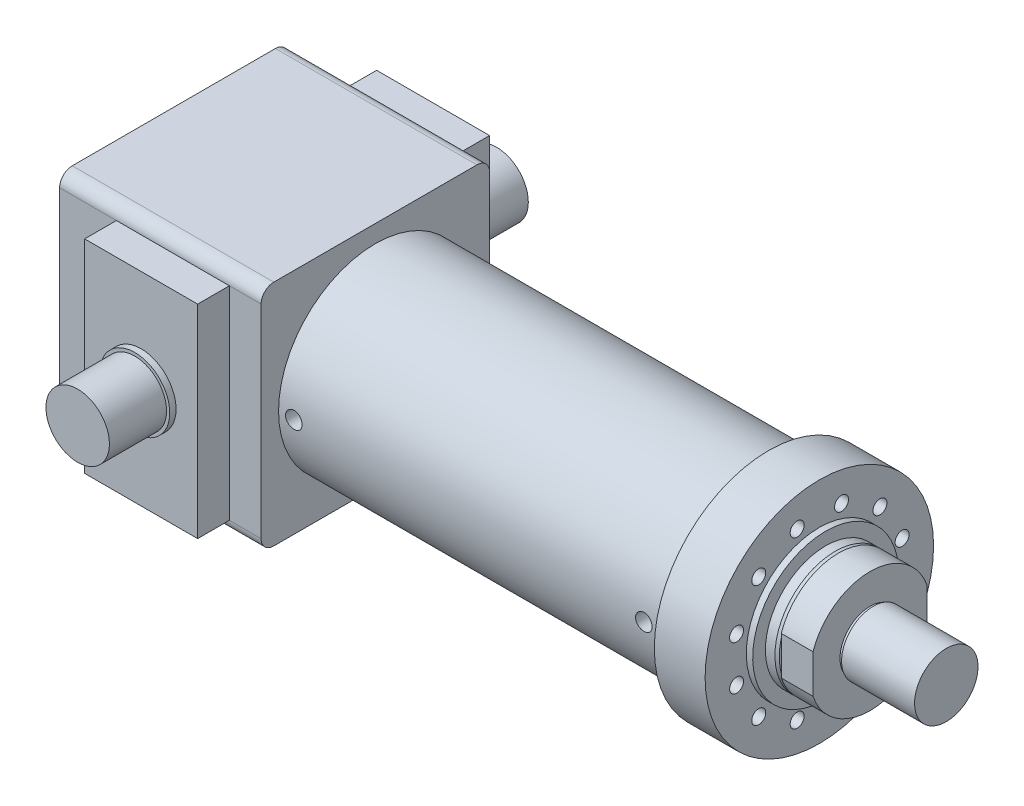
ISO-10303-21;
HEADER;
FILE_DESCRIPTION(('STEP AP214'),'2;1');
FILE_NAME('part.step','',(''),(''),'','','');
FILE_SCHEMA(('AUTOMOTIVE_DESIGN { 1 0 10303 214 1 1 1 1 }'));
ENDSEC;
DATA;
#1=APPLICATION_CONTEXT('core data for automotive mechanical design processes');
#2=APPLICATION_PROTOCOL_DEFINITION('international standard','automotive_design',2000,#1);
#3=PRODUCT_CONTEXT('',#1,'mechanical');
#4=PRODUCT('Part','Part','',(#3));
#5=PRODUCT_RELATED_PRODUCT_CATEGORY('part','',(#4));
#6=PRODUCT_DEFINITION_FORMATION('','',#4);
#7=PRODUCT_DEFINITION_CONTEXT('part definition',#1,'design');
#8=PRODUCT_DEFINITION('design','',#6,#7);
#9=PRODUCT_DEFINITION_SHAPE('','',#8);
#10=(LENGTH_UNIT() NAMED_UNIT(*) SI_UNIT(.MILLI.,.METRE.));
#11=(NAMED_UNIT(*) PLANE_ANGLE_UNIT() SI_UNIT($,.RADIAN.));
#12=(NAMED_UNIT(*) SI_UNIT($,.STERADIAN.) SOLID_ANGLE_UNIT());
#13=UNCERTAINTY_MEASURE_WITH_UNIT(LENGTH_MEASURE(1.E-05),#10,'distance_accuracy_value','');
#14=(GEOMETRIC_REPRESENTATION_CONTEXT(3) GLOBAL_UNCERTAINTY_ASSIGNED_CONTEXT((#13)) GLOBAL_UNIT_ASSIGNED_CONTEXT((#10,
#11,#12)) REPRESENTATION_CONTEXT('',''));
#15=CARTESIAN_POINT('',(0.,0.,0.));
#16=DIRECTION('',(0.,0.,1.));
#17=DIRECTION('',(1.,0.,0.));
#18=AXIS2_PLACEMENT_3D('',#15,#16,#17);
#19=CARTESIAN_POINT('',(779.5,0.,0.));
#20=DIRECTION('',(-1.,0.,0.));
#21=DIRECTION('',(0.,-1.,0.));
#22=AXIS2_PLACEMENT_3D('',#19,#20,#21);
#23=CYLINDRICAL_SURFACE('',#22,95.);
#24=CARTESIAN_POINT('',(729.5,0.,0.));
#25=DIRECTION('',(1.,0.,0.));
#26=DIRECTION('',(0.,1.,0.));
#27=AXIS2_PLACEMENT_3D('',#24,#25,#26);
#28=CIRCLE('',#27,95.);
#29=CARTESIAN_POINT('',(729.5,30.4138126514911,-90.));
#30=VERTEX_POINT('',#29);
#31=CARTESIAN_POINT('',(729.5,30.4138126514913,90.));
#32=VERTEX_POINT('',#31);
#33=EDGE_CURVE('E115',#30,#32,#28,.T.);
#34=ORIENTED_EDGE('',*,*,#33,.T.);
#35=DIRECTION('',(-1.,0.,0.));
#36=VECTOR('',#35,1.);
#37=CARTESIAN_POINT('',(779.5,30.4138126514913,90.));
#38=LINE('',#37,#36);
#39=CARTESIAN_POINT('',(779.5,30.4138126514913,90.));
#40=VERTEX_POINT('',#39);
#41=EDGE_CURVE('E52',#40,#32,#38,.T.);
#42=ORIENTED_EDGE('',*,*,#41,.F.);
#43=CARTESIAN_POINT('',(779.5,0.,0.));
#44=DIRECTION('',(1.,0.,0.));
#45=DIRECTION('',(0.,1.,0.));
#46=AXIS2_PLACEMENT_3D('',#43,#44,#45);
#47=CIRCLE('',#46,95.);
#48=CARTESIAN_POINT('',(779.5,30.4138126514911,-90.));
#49=VERTEX_POINT('',#48);
#50=EDGE_CURVE('E102',#49,#40,#47,.T.);
#51=ORIENTED_EDGE('',*,*,#50,.F.);
#52=DIRECTION('',(-1.,0.,0.));
#53=VECTOR('',#52,1.);
#54=CARTESIAN_POINT('',(779.5,30.4138126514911,-90.));
#55=LINE('',#54,#53);
#56=EDGE_CURVE('E111',#49,#30,#55,.T.);
#57=ORIENTED_EDGE('',*,*,#56,.T.);
#58=EDGE_LOOP('',(#34,#42,#51,#57));
#59=FACE_BOUND('',#58,.T.);
#60=ADVANCED_FACE('F49',(#59),#23,.T.);
#61=CARTESIAN_POINT('',(779.5,30.4138126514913,90.));
#62=DIRECTION('',(0.,0.,-1.));
#63=DIRECTION('',(-1.,0.,0.));
#64=AXIS2_PLACEMENT_3D('',#61,#62,#63);
#65=PLANE('',#64);
#66=DIRECTION('',(0.,-1.,0.));
#67=VECTOR('',#66,1.);
#68=CARTESIAN_POINT('',(729.5,30.4138126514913,90.));
#69=LINE('',#68,#67);
#70=CARTESIAN_POINT('',(729.5,-30.4138126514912,90.));
#71=VERTEX_POINT('',#70);
#72=EDGE_CURVE('E107',#32,#71,#69,.T.);
#73=ORIENTED_EDGE('',*,*,#72,.T.);
#74=DIRECTION('',(-1.,0.,0.));
#75=VECTOR('',#74,1.);
#76=CARTESIAN_POINT('',(779.5,-30.4138126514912,90.));
#77=LINE('',#76,#75);
#78=CARTESIAN_POINT('',(779.5,-30.4138126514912,90.));
#79=VERTEX_POINT('',#78);
#80=EDGE_CURVE('E105',#79,#71,#77,.T.);
#81=ORIENTED_EDGE('',*,*,#80,.F.);
#82=DIRECTION('',(0.,-1.,0.));
#83=VECTOR('',#82,1.);
#84=CARTESIAN_POINT('',(779.5,30.4138126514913,90.));
#85=LINE('',#84,#83);
#86=EDGE_CURVE('E97',#40,#79,#85,.T.);
#87=ORIENTED_EDGE('',*,*,#86,.F.);
#88=ORIENTED_EDGE('',*,*,#41,.T.);
#89=EDGE_LOOP('',(#73,#81,#87,#88));
#90=FACE_BOUND('',#89,.T.);
#91=ADVANCED_FACE('F106',(#90),#65,.F.);
#92=CARTESIAN_POINT('',(779.5,0.,0.));
#93=DIRECTION('',(-1.,0.,0.));
#94=DIRECTION('',(0.,-1.,0.));
#95=AXIS2_PLACEMENT_3D('',#92,#93,#94);
#96=CYLINDRICAL_SURFACE('',#95,95.);
#97=CARTESIAN_POINT('',(729.5,0.,0.));
#98=DIRECTION('',(1.,0.,0.));
#99=DIRECTION('',(0.,1.,0.));
#100=AXIS2_PLACEMENT_3D('',#97,#98,#99);
#101=CIRCLE('',#100,95.);
#102=CARTESIAN_POINT('',(729.5,-30.413812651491,-90.));
#103=VERTEX_POINT('',#102);
#104=EDGE_CURVE('E83',#71,#103,#101,.T.);
#105=ORIENTED_EDGE('',*,*,#104,.T.);
#106=DIRECTION('',(-1.,0.,0.));
#107=VECTOR('',#106,1.);
#108=CARTESIAN_POINT('',(779.5,-30.413812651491,-90.));
#109=LINE('',#108,#107);
#110=CARTESIAN_POINT('',(779.5,-30.413812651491,-90.));
#111=VERTEX_POINT('',#110);
#112=EDGE_CURVE('E108',#111,#103,#109,.T.);
#113=ORIENTED_EDGE('',*,*,#112,.F.);
#114=CARTESIAN_POINT('',(779.5,0.,0.));
#115=DIRECTION('',(1.,0.,0.));
#116=DIRECTION('',(0.,1.,0.));
#117=AXIS2_PLACEMENT_3D('',#114,#115,#116);
#118=CIRCLE('',#117,95.);
#119=EDGE_CURVE('E100',#79,#111,#118,.T.);
#120=ORIENTED_EDGE('',*,*,#119,.F.);
#121=ORIENTED_EDGE('',*,*,#80,.T.);
#122=EDGE_LOOP('',(#105,#113,#120,#121));
#123=FACE_BOUND('',#122,.T.);
#124=ADVANCED_FACE('F109',(#123),#96,.T.);
#125=CARTESIAN_POINT('',(779.5,30.4138126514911,-90.));
#126=DIRECTION('',(0.,0.,1.));
#127=DIRECTION('',(1.,0.,0.));
#128=AXIS2_PLACEMENT_3D('',#125,#126,#127);
#129=PLANE('',#128);
#130=DIRECTION('',(0.,1.,0.));
#131=VECTOR('',#130,1.);
#132=CARTESIAN_POINT('',(729.5,30.4138126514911,-90.));
#133=LINE('',#132,#131);
#134=EDGE_CURVE('E89',#103,#30,#133,.T.);
#135=ORIENTED_EDGE('',*,*,#134,.T.);
#136=ORIENTED_EDGE('',*,*,#56,.F.);
#137=DIRECTION('',(0.,1.,0.));
#138=VECTOR('',#137,1.);
#139=CARTESIAN_POINT('',(779.5,30.4138126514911,-90.));
#140=LINE('',#139,#138);
#141=EDGE_CURVE('E66',#111,#49,#140,.T.);
#142=ORIENTED_EDGE('',*,*,#141,.F.);
#143=ORIENTED_EDGE('',*,*,#112,.T.);
#144=EDGE_LOOP('',(#135,#136,#142,#143));
#145=FACE_BOUND('',#144,.T.);
#146=ADVANCED_FACE('F123',(#145),#129,.F.);
#147=CARTESIAN_POINT('',(779.5,0.,0.));
#148=DIRECTION('',(1.,0.,0.));
#149=DIRECTION('',(0.,1.,0.));
#150=AXIS2_PLACEMENT_3D('',#147,#148,#149);
#151=PLANE('',#150);
#152=CARTESIAN_POINT('',(779.5,0.,0.));
#153=DIRECTION('',(1.,0.,0.));
#154=DIRECTION('',(0.,1.,0.));
#155=AXIS2_PLACEMENT_3D('',#152,#153,#154);
#156=CIRCLE('',#155,47.5);
#157=CARTESIAN_POINT('',(779.5,47.5,0.));
#158=VERTEX_POINT('',#157);
#159=EDGE_CURVE('E12',#158,#158,#156,.T.);
#160=ORIENTED_EDGE('',*,*,#159,.F.);
#161=EDGE_LOOP('',(#160));
#162=FACE_BOUND('',#161,.T.);
#163=ORIENTED_EDGE('',*,*,#50,.T.);
#164=ORIENTED_EDGE('',*,*,#86,.T.);
#165=ORIENTED_EDGE('',*,*,#119,.T.);
#166=ORIENTED_EDGE('',*,*,#141,.T.);
#167=EDGE_LOOP('',(#163,#164,#165,#166));
#168=FACE_BOUND('',#167,.T.);
#169=ADVANCED_FACE('F98',(#162,#168),#151,.T.);
#170=CARTESIAN_POINT('',(729.5,0.,0.));
#171=DIRECTION('',(1.,0.,0.));
#172=DIRECTION('',(0.,1.,0.));
#173=AXIS2_PLACEMENT_3D('',#170,#171,#172);
#174=PLANE('',#173);
#175=ORIENTED_EDGE('',*,*,#33,.F.);
#176=ORIENTED_EDGE('',*,*,#134,.F.);
#177=ORIENTED_EDGE('',*,*,#104,.F.);
#178=ORIENTED_EDGE('',*,*,#72,.F.);
#179=EDGE_LOOP('',(#175,#176,#177,#178));
#180=FACE_BOUND('',#179,.T.);
#181=ADVANCED_FACE('F126',(#180),#174,.F.);
#182=CARTESIAN_POINT('',(784.5,0.,0.));
#183=DIRECTION('',(-1.,0.,0.));
#184=DIRECTION('',(0.,-1.,0.));
#185=AXIS2_PLACEMENT_3D('',#182,#183,#184);
#186=CYLINDRICAL_SURFACE('',#185,47.5);
#187=CARTESIAN_POINT('',(784.5,0.,0.));
#188=DIRECTION('',(1.,0.,0.));
#189=DIRECTION('',(0.,1.,0.));
#190=AXIS2_PLACEMENT_3D('',#187,#188,#189);
#191=CIRCLE('',#190,47.5);
#192=CARTESIAN_POINT('',(784.5,47.5,0.));
#193=VERTEX_POINT('',#192);
#194=EDGE_CURVE('E118',#193,#193,#191,.T.);
#195=ORIENTED_EDGE('',*,*,#194,.F.);
#196=EDGE_LOOP('',(#195));
#197=FACE_BOUND('',#196,.T.);
#198=ORIENTED_EDGE('',*,*,#159,.T.);
#199=EDGE_LOOP('',(#198));
#200=FACE_BOUND('',#199,.T.);
#201=ADVANCED_FACE('F143',(#197,#200),#186,.T.);
#202=CARTESIAN_POINT('',(899.5,0.,0.));
#203=DIRECTION('',(-1.,0.,0.));
#204=DIRECTION('',(0.,-1.,0.));
#205=AXIS2_PLACEMENT_3D('',#202,#203,#204);
#206=CYLINDRICAL_SURFACE('',#205,50.);
#207=CARTESIAN_POINT('',(899.5,0.,0.));
#208=DIRECTION('',(1.,0.,0.));
#209=DIRECTION('',(0.,1.,0.));
#210=AXIS2_PLACEMENT_3D('',#207,#208,#209);
#211=CIRCLE('',#210,50.);
#212=CARTESIAN_POINT('',(899.5,50.,0.));
#213=VERTEX_POINT('',#212);
#214=EDGE_CURVE('E131',#213,#213,#211,.T.);
#215=ORIENTED_EDGE('',*,*,#214,.F.);
#216=EDGE_LOOP('',(#215));
#217=FACE_BOUND('',#216,.T.);
#218=CARTESIAN_POINT('',(784.5,0.,0.));
#219=DIRECTION('',(1.,0.,0.));
#220=DIRECTION('',(0.,1.,0.));
#221=AXIS2_PLACEMENT_3D('',#218,#219,#220);
#222=CIRCLE('',#221,50.);
#223=CARTESIAN_POINT('',(784.5,50.,0.));
#224=VERTEX_POINT('',#223);
#225=EDGE_CURVE('E132',#224,#224,#222,.T.);
#226=ORIENTED_EDGE('',*,*,#225,.T.);
#227=EDGE_LOOP('',(#226));
#228=FACE_BOUND('',#227,.T.);
#229=ADVANCED_FACE('F140',(#217,#228),#206,.T.);
#230=CARTESIAN_POINT('',(899.5,0.,0.));
#231=DIRECTION('',(1.,0.,0.));
#232=DIRECTION('',(0.,1.,0.));
#233=AXIS2_PLACEMENT_3D('',#230,#231,#232);
#234=PLANE('',#233);
#235=ORIENTED_EDGE('',*,*,#214,.T.);
#236=EDGE_LOOP('',(#235));
#237=FACE_BOUND('',#236,.T.);
#238=ADVANCED_FACE('F138',(#237),#234,.T.);
#239=CARTESIAN_POINT('',(784.5,0.,0.));
#240=DIRECTION('',(1.,0.,0.));
#241=DIRECTION('',(0.,1.,0.));
#242=AXIS2_PLACEMENT_3D('',#239,#240,#241);
#243=PLANE('',#242);
#244=ORIENTED_EDGE('',*,*,#194,.T.);
#245=EDGE_LOOP('',(#244));
#246=FACE_BOUND('',#245,.T.);
#247=ORIENTED_EDGE('',*,*,#225,.F.);
#248=EDGE_LOOP('',(#247));
#249=FACE_BOUND('',#248,.T.);
#250=ADVANCED_FACE('F147',(#246,#249),#243,.F.);
#251=CLOSED_SHELL('',(#60,#91,#124,#146,#169,#181,#201,#229,#238,#250));
#252=MANIFOLD_SOLID_BREP('B2',#251);
#253=CARTESIAN_POINT('',(729.5,0.,0.));
#254=DIRECTION('',(-1.,0.,0.));
#255=DIRECTION('',(0.,-1.,0.));
#256=AXIS2_PLACEMENT_3D('',#253,#254,#255);
#257=CYLINDRICAL_SURFACE('',#256,95.);
#258=CARTESIAN_POINT('',(724.5,0.,0.));
#259=DIRECTION('',(1.,0.,0.));
#260=DIRECTION('',(0.,1.,0.));
#261=AXIS2_PLACEMENT_3D('',#258,#259,#260);
#262=CIRCLE('',#261,95.);
#263=CARTESIAN_POINT('',(724.5,95.,0.));
#264=VERTEX_POINT('',#263);
#265=EDGE_CURVE('E48',#264,#264,#262,.F.);
#266=ORIENTED_EDGE('',*,*,#265,.T.);
#267=EDGE_LOOP('',(#266));
#268=FACE_BOUND('',#267,.T.);
#269=CARTESIAN_POINT('',(709.5,0.,0.));
#270=DIRECTION('',(1.,0.,0.));
#271=DIRECTION('',(0.,1.,0.));
#272=AXIS2_PLACEMENT_3D('',#269,#270,#271);
#273=CIRCLE('',#272,95.);
#274=CARTESIAN_POINT('',(709.5,95.,0.));
#275=VERTEX_POINT('',#274);
#276=EDGE_CURVE('E251',#275,#275,#273,.T.);
#277=ORIENTED_EDGE('',*,*,#276,.T.);
#278=EDGE_LOOP('',(#277));
#279=FACE_BOUND('',#278,.T.);
#280=ADVANCED_FACE('F240',(#268,#279),#257,.T.);
#281=CARTESIAN_POINT('',(729.5,0.,0.));
#282=DIRECTION('',(1.,0.,0.));
#283=DIRECTION('',(0.,1.,0.));
#284=AXIS2_PLACEMENT_3D('',#281,#282,#283);
#285=PLANE('',#284);
#286=CARTESIAN_POINT('',(729.5,0.,0.));
#287=DIRECTION('',(1.,0.,0.));
#288=DIRECTION('',(0.,1.,0.));
#289=AXIS2_PLACEMENT_3D('',#286,#287,#288);
#290=CIRCLE('',#289,93.180148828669);
#291=CARTESIAN_POINT('',(729.5,93.180148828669,0.));
#292=VERTEX_POINT('',#291);
#293=EDGE_CURVE('E247',#292,#292,#290,.T.);
#294=ORIENTED_EDGE('',*,*,#293,.T.);
#295=EDGE_LOOP('',(#294));
#296=FACE_BOUND('',#295,.T.);
#297=ADVANCED_FACE('F261',(#296),#285,.T.);
#298=CARTESIAN_POINT('',(709.5,0.,0.));
#299=DIRECTION('',(1.,0.,0.));
#300=DIRECTION('',(0.,1.,0.));
#301=AXIS2_PLACEMENT_3D('',#298,#299,#300);
#302=PLANE('',#301);
#303=ORIENTED_EDGE('',*,*,#276,.F.);
#304=EDGE_LOOP('',(#303));
#305=FACE_BOUND('',#304,.T.);
#306=ADVANCED_FACE('F259',(#305),#302,.F.);
#307=CARTESIAN_POINT('',(729.5,0.,0.));
#308=DIRECTION('',(-1.,0.,0.));
#309=DIRECTION('',(0.,-1.,0.));
#310=AXIS2_PLACEMENT_3D('',#307,#308,#309);
#311=CONICAL_SURFACE('',#310,93.180148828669,0.349065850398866);
#312=ORIENTED_EDGE('',*,*,#265,.F.);
#313=EDGE_LOOP('',(#312));
#314=FACE_BOUND('',#313,.T.);
#315=ORIENTED_EDGE('',*,*,#293,.F.);
#316=EDGE_LOOP('',(#315));
#317=FACE_BOUND('',#316,.T.);
#318=ADVANCED_FACE('F242',(#314,#317),#311,.T.);
#319=CLOSED_SHELL('',(#280,#297,#306,#318));
#320=MANIFOLD_SOLID_BREP('B6',#319);
#321=CARTESIAN_POINT('',(709.5,0.,0.));
#322=DIRECTION('',(-1.,0.,0.));
#323=DIRECTION('',(0.,-1.,0.));
#324=AXIS2_PLACEMENT_3D('',#321,#322,#323);
#325=CYLINDRICAL_SURFACE('',#324,115.);
#326=CARTESIAN_POINT('',(709.5,0.,0.));
#327=DIRECTION('',(1.,0.,0.));
#328=DIRECTION('',(0.,1.,0.));
#329=AXIS2_PLACEMENT_3D('',#326,#327,#328);
#330=CIRCLE('',#329,115.);
#331=CARTESIAN_POINT('',(709.5,115.,0.));
#332=VERTEX_POINT('',#331);
#333=EDGE_CURVE('E239',#332,#332,#330,.T.);
#334=ORIENTED_EDGE('',*,*,#333,.F.);
#335=EDGE_LOOP('',(#334));
#336=FACE_BOUND('',#335,.T.);
#337=CARTESIAN_POINT('',(699.5,0.,0.));
#338=DIRECTION('',(1.,0.,0.));
#339=DIRECTION('',(0.,1.,0.));
#340=AXIS2_PLACEMENT_3D('',#337,#338,#339);
#341=CIRCLE('',#340,115.);
#342=CARTESIAN_POINT('',(699.5,115.,0.));
#343=VERTEX_POINT('',#342);
#344=EDGE_CURVE('E307',#343,#343,#341,.T.);
#345=ORIENTED_EDGE('',*,*,#344,.T.);
#346=EDGE_LOOP('',(#345));
#347=FACE_BOUND('',#346,.T.);
#348=ADVANCED_FACE('F304',(#336,#347),#325,.T.);
#349=CARTESIAN_POINT('',(709.5,0.,0.));
#350=DIRECTION('',(1.,0.,0.));
#351=DIRECTION('',(0.,1.,0.));
#352=AXIS2_PLACEMENT_3D('',#349,#350,#351);
#353=PLANE('',#352);
#354=ORIENTED_EDGE('',*,*,#333,.T.);
#355=EDGE_LOOP('',(#354));
#356=FACE_BOUND('',#355,.T.);
#357=ADVANCED_FACE('F319',(#356),#353,.T.);
#358=CARTESIAN_POINT('',(699.5,0.,0.));
#359=DIRECTION('',(1.,0.,0.));
#360=DIRECTION('',(0.,1.,0.));
#361=AXIS2_PLACEMENT_3D('',#358,#359,#360);
#362=PLANE('',#361);
#363=ORIENTED_EDGE('',*,*,#344,.F.);
#364=EDGE_LOOP('',(#363));
#365=FACE_BOUND('',#364,.T.);
#366=ADVANCED_FACE('F317',(#365),#362,.F.);
#367=CLOSED_SHELL('',(#348,#357,#366));
#368=MANIFOLD_SOLID_BREP('B43',#367);
#369=CARTESIAN_POINT('',(0.,0.,230.));
#370=DIRECTION('',(0.,0.,1.));
#371=DIRECTION('',(1.,0.,0.));
#372=AXIS2_PLACEMENT_3D('',#369,#370,#371);
#373=PLANE('',#372);
#374=DIRECTION('',(0.,-1.,0.));
#375=VECTOR('',#374,1.);
#376=CARTESIAN_POINT('',(-228.,160.,230.));
#377=LINE('',#376,#375);
#378=CARTESIAN_POINT('',(-228.,160.,230.));
#379=VERTEX_POINT('',#378);
#380=CARTESIAN_POINT('',(-228.,-160.,230.));
#381=VERTEX_POINT('',#380);
#382=EDGE_CURVE('E859',#379,#381,#377,.T.);
#383=ORIENTED_EDGE('',*,*,#382,.T.);
#384=DIRECTION('',(1.,0.,0.));
#385=VECTOR('',#384,1.);
#386=CARTESIAN_POINT('',(-228.,-160.,230.));
#387=LINE('',#386,#385);
#388=CARTESIAN_POINT('',(-50.,-160.,230.));
#389=VERTEX_POINT('',#388);
#390=EDGE_CURVE('E823',#381,#389,#387,.T.);
#391=ORIENTED_EDGE('',*,*,#390,.T.);
#392=DIRECTION('',(0.,1.,0.));
#393=VECTOR('',#392,1.);
#394=CARTESIAN_POINT('',(-50.,160.,230.));
#395=LINE('',#394,#393);
#396=CARTESIAN_POINT('',(-50.,160.,230.));
#397=VERTEX_POINT('',#396);
#398=EDGE_CURVE('E864',#389,#397,#395,.T.);
#399=ORIENTED_EDGE('',*,*,#398,.T.);
#400=DIRECTION('',(-1.,0.,0.));
#401=VECTOR('',#400,1.);
#402=CARTESIAN_POINT('',(-228.,160.,230.));
#403=LINE('',#402,#401);
#404=EDGE_CURVE('E867',#397,#379,#403,.T.);
#405=ORIENTED_EDGE('',*,*,#404,.T.);
#406=EDGE_LOOP('',(#383,#391,#399,#405));
#407=FACE_BOUND('',#406,.T.);
#408=CARTESIAN_POINT('',(-139.,-0.426720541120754,230.));
#409=DIRECTION('',(0.,0.,1.));
#410=DIRECTION('',(1.,0.,0.));
#411=AXIS2_PLACEMENT_3D('',#408,#409,#410);
#412=CIRCLE('',#411,55.);
#413=CARTESIAN_POINT('',(-84.,-0.426720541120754,230.));
#414=VERTEX_POINT('',#413);
#415=EDGE_CURVE('E1077',#414,#414,#412,.T.);
#416=ORIENTED_EDGE('',*,*,#415,.F.);
#417=EDGE_LOOP('',(#416));
#418=FACE_BOUND('',#417,.T.);
#419=ADVANCED_FACE('F345',(#407,#418),#373,.T.);
#420=CARTESIAN_POINT('',(-228.,180.,-180.));
#421=DIRECTION('',(0.,0.,1.));
#422=DIRECTION('',(1.,0.,0.));
#423=AXIS2_PLACEMENT_3D('',#420,#421,#422);
#424=PLANE('',#423);
#425=DIRECTION('',(0.,-1.,0.));
#426=VECTOR('',#425,1.);
#427=CARTESIAN_POINT('',(-50.,160.,-180.));
#428=LINE('',#427,#426);
#429=CARTESIAN_POINT('',(-50.,160.,-180.));
#430=VERTEX_POINT('',#429);
#431=CARTESIAN_POINT('',(-50.,-160.,-180.));
#432=VERTEX_POINT('',#431);
#433=EDGE_CURVE('E489',#430,#432,#428,.T.);
#434=ORIENTED_EDGE('',*,*,#433,.F.);
#435=DIRECTION('',(1.,0.,0.));
#436=VECTOR('',#435,1.);
#437=CARTESIAN_POINT('',(-228.,160.,-180.));
#438=LINE('',#437,#436);
#439=CARTESIAN_POINT('',(0.,160.,-180.));
#440=VERTEX_POINT('',#439);
#441=EDGE_CURVE('E884',#430,#440,#438,.T.);
#442=ORIENTED_EDGE('',*,*,#441,.T.);
#443=DIRECTION('',(0.,-1.,0.));
#444=VECTOR('',#443,1.);
#445=CARTESIAN_POINT('',(0.,180.,-180.));
#446=LINE('',#445,#444);
#447=CARTESIAN_POINT('',(0.,-160.,-180.));
#448=VERTEX_POINT('',#447);
#449=EDGE_CURVE('E536',#440,#448,#446,.T.);
#450=ORIENTED_EDGE('',*,*,#449,.T.);
#451=DIRECTION('',(1.,0.,0.));
#452=VECTOR('',#451,1.);
#453=CARTESIAN_POINT('',(-228.,-160.,-180.));
#454=LINE('',#453,#452);
#455=EDGE_CURVE('E889',#448,#432,#454,.F.);
#456=ORIENTED_EDGE('',*,*,#455,.T.);
#457=EDGE_LOOP('',(#434,#442,#450,#456));
#458=FACE_BOUND('',#457,.T.);
#459=ADVANCED_FACE('F758',(#458),#424,.F.);
#460=CARTESIAN_POINT('',(-228.,180.,-180.));
#461=DIRECTION('',(0.,-1.,0.));
#462=DIRECTION('',(1.,0.,0.));
#463=AXIS2_PLACEMENT_3D('',#460,#461,#462);
#464=PLANE('',#463);
#465=DIRECTION('',(1.,0.,0.));
#466=VECTOR('',#465,1.);
#467=CARTESIAN_POINT('',(-228.,180.,160.));
#468=LINE('',#467,#466);
#469=CARTESIAN_POINT('',(-317.5,180.,160.));
#470=VERTEX_POINT('',#469);
#471=CARTESIAN_POINT('',(0.,180.,160.));
#472=VERTEX_POINT('',#471);
#473=EDGE_CURVE('E892',#470,#472,#468,.T.);
#474=ORIENTED_EDGE('',*,*,#473,.T.);
#475=DIRECTION('',(0.,0.,-1.));
#476=VECTOR('',#475,1.);
#477=CARTESIAN_POINT('',(0.,180.,-180.));
#478=LINE('',#477,#476);
#479=CARTESIAN_POINT('',(0.,180.,-160.));
#480=VERTEX_POINT('',#479);
#481=EDGE_CURVE('E532',#472,#480,#478,.T.);
#482=ORIENTED_EDGE('',*,*,#481,.T.);
#483=DIRECTION('',(1.,0.,0.));
#484=VECTOR('',#483,1.);
#485=CARTESIAN_POINT('',(-228.,180.,-160.));
#486=LINE('',#485,#484);
#487=CARTESIAN_POINT('',(-317.5,180.,-160.));
#488=VERTEX_POINT('',#487);
#489=EDGE_CURVE('E895',#480,#488,#486,.F.);
#490=ORIENTED_EDGE('',*,*,#489,.T.);
#491=DIRECTION('',(0.,0.,-1.));
#492=VECTOR('',#491,1.);
#493=CARTESIAN_POINT('',(-317.5,180.,-180.));
#494=LINE('',#493,#492);
#495=EDGE_CURVE('E913',#470,#488,#494,.T.);
#496=ORIENTED_EDGE('',*,*,#495,.F.);
#497=EDGE_LOOP('',(#474,#482,#490,#496));
#498=FACE_BOUND('',#497,.T.);
#499=ADVANCED_FACE('F764',(#498),#464,.F.);
#500=CARTESIAN_POINT('',(-317.5,160.,-180.));
#501=VERTEX_POINT('',#500);
#502=CARTESIAN_POINT('',(-228.,160.,-180.));
#503=VERTEX_POINT('',#502);
#504=EDGE_CURVE('E885',#501,#503,#438,.T.);
#505=ORIENTED_EDGE('',*,*,#504,.T.);
#506=DIRECTION('',(0.,-1.,0.));
#507=VECTOR('',#506,1.);
#508=CARTESIAN_POINT('',(-228.,160.,-180.));
#509=LINE('',#508,#507);
#510=CARTESIAN_POINT('',(-228.,-160.,-180.));
#511=VERTEX_POINT('',#510);
#512=EDGE_CURVE('E361',#503,#511,#509,.T.);
#513=ORIENTED_EDGE('',*,*,#512,.T.);
#514=CARTESIAN_POINT('',(-317.5,-160.,-180.));
#515=VERTEX_POINT('',#514);
#516=EDGE_CURVE('E888',#511,#515,#454,.F.);
#517=ORIENTED_EDGE('',*,*,#516,.T.);
#518=DIRECTION('',(0.,-1.,0.));
#519=VECTOR('',#518,1.);
#520=CARTESIAN_POINT('',(-317.5,180.,-180.));
#521=LINE('',#520,#519);
#522=EDGE_CURVE('E917',#501,#515,#521,.T.);
#523=ORIENTED_EDGE('',*,*,#522,.F.);
#524=EDGE_LOOP('',(#505,#513,#517,#523));
#525=FACE_BOUND('',#524,.T.);
#526=ADVANCED_FACE('F767',(#525),#424,.F.);
#527=CARTESIAN_POINT('',(-228.,-180.,-180.));
#528=DIRECTION('',(0.,1.,0.));
#529=DIRECTION('',(-1.,0.,0.));
#530=AXIS2_PLACEMENT_3D('',#527,#528,#529);
#531=PLANE('',#530);
#532=DIRECTION('',(1.,0.,0.));
#533=VECTOR('',#532,1.);
#534=CARTESIAN_POINT('',(-228.,-180.,160.));
#535=LINE('',#534,#533);
#536=CARTESIAN_POINT('',(0.,-180.,160.));
#537=VERTEX_POINT('',#536);
#538=CARTESIAN_POINT('',(-317.5,-180.,160.));
#539=VERTEX_POINT('',#538);
#540=EDGE_CURVE('E826',#537,#539,#535,.F.);
#541=ORIENTED_EDGE('',*,*,#540,.T.);
#542=DIRECTION('',(0.,0.,1.));
#543=VECTOR('',#542,1.);
#544=CARTESIAN_POINT('',(-317.5,-180.,-180.));
#545=LINE('',#544,#543);
#546=CARTESIAN_POINT('',(-317.5,-180.,-160.));
#547=VERTEX_POINT('',#546);
#548=EDGE_CURVE('E845',#547,#539,#545,.T.);
#549=ORIENTED_EDGE('',*,*,#548,.F.);
#550=DIRECTION('',(1.,0.,0.));
#551=VECTOR('',#550,1.);
#552=CARTESIAN_POINT('',(-228.,-180.,-160.));
#553=LINE('',#552,#551);
#554=CARTESIAN_POINT('',(0.,-180.,-160.));
#555=VERTEX_POINT('',#554);
#556=EDGE_CURVE('E881',#547,#555,#553,.T.);
#557=ORIENTED_EDGE('',*,*,#556,.T.);
#558=DIRECTION('',(0.,0.,1.));
#559=VECTOR('',#558,1.);
#560=CARTESIAN_POINT('',(0.,-180.,-180.));
#561=LINE('',#560,#559);
#562=EDGE_CURVE('E528',#555,#537,#561,.T.);
#563=ORIENTED_EDGE('',*,*,#562,.T.);
#564=EDGE_LOOP('',(#541,#549,#557,#563));
#565=FACE_BOUND('',#564,.T.);
#566=ADVANCED_FACE('F785',(#565),#531,.F.);
#567=CARTESIAN_POINT('',(-228.,0.,0.));
#568=DIRECTION('',(-1.,0.,0.));
#569=DIRECTION('',(0.,-1.,0.));
#570=AXIS2_PLACEMENT_3D('',#567,#568,#569);
#571=PLANE('',#570);
#572=DIRECTION('',(0.,1.,0.));
#573=VECTOR('',#572,1.);
#574=CARTESIAN_POINT('',(-228.,180.,180.));
#575=LINE('',#574,#573);
#576=CARTESIAN_POINT('',(-228.,-160.,180.));
#577=VERTEX_POINT('',#576);
#578=CARTESIAN_POINT('',(-228.,160.,180.));
#579=VERTEX_POINT('',#578);
#580=EDGE_CURVE('E832',#577,#579,#575,.T.);
#581=ORIENTED_EDGE('',*,*,#580,.F.);
#582=DIRECTION('',(0.,0.,-1.));
#583=VECTOR('',#582,1.);
#584=CARTESIAN_POINT('',(-228.,-160.,230.));
#585=LINE('',#584,#583);
#586=EDGE_CURVE('E822',#381,#577,#585,.T.);
#587=ORIENTED_EDGE('',*,*,#586,.F.);
#588=ORIENTED_EDGE('',*,*,#382,.F.);
#589=DIRECTION('',(0.,0.,-1.));
#590=VECTOR('',#589,1.);
#591=CARTESIAN_POINT('',(-228.,160.,230.));
#592=LINE('',#591,#590);
#593=EDGE_CURVE('E870',#379,#579,#592,.T.);
#594=ORIENTED_EDGE('',*,*,#593,.T.);
#595=EDGE_LOOP('',(#581,#587,#588,#594));
#596=FACE_BOUND('',#595,.T.);
#597=ADVANCED_FACE('F781',(#596),#571,.T.);
#598=CARTESIAN_POINT('',(-50.,0.,0.));
#599=DIRECTION('',(-1.,0.,0.));
#600=DIRECTION('',(0.,-1.,0.));
#601=AXIS2_PLACEMENT_3D('',#598,#599,#600);
#602=PLANE('',#601);
#603=DIRECTION('',(0.,0.,-1.));
#604=VECTOR('',#603,1.);
#605=CARTESIAN_POINT('',(-50.,-160.,230.));
#606=LINE('',#605,#604);
#607=CARTESIAN_POINT('',(-50.,-160.,180.));
#608=VERTEX_POINT('',#607);
#609=EDGE_CURVE('E827',#389,#608,#606,.T.);
#610=ORIENTED_EDGE('',*,*,#609,.T.);
#611=DIRECTION('',(0.,1.,0.));
#612=VECTOR('',#611,1.);
#613=CARTESIAN_POINT('',(-50.,180.,180.));
#614=LINE('',#613,#612);
#615=CARTESIAN_POINT('',(-50.,160.,180.));
#616=VERTEX_POINT('',#615);
#617=EDGE_CURVE('E523',#608,#616,#614,.T.);
#618=ORIENTED_EDGE('',*,*,#617,.T.);
#619=DIRECTION('',(0.,0.,-1.));
#620=VECTOR('',#619,1.);
#621=CARTESIAN_POINT('',(-50.,160.,230.));
#622=LINE('',#621,#620);
#623=EDGE_CURVE('E873',#397,#616,#622,.T.);
#624=ORIENTED_EDGE('',*,*,#623,.F.);
#625=ORIENTED_EDGE('',*,*,#398,.F.);
#626=EDGE_LOOP('',(#610,#618,#624,#625));
#627=FACE_BOUND('',#626,.T.);
#628=ADVANCED_FACE('F784',(#627),#602,.F.);
#629=CARTESIAN_POINT('',(-228.,-160.,-160.));
#630=DIRECTION('',(1.,0.,0.));
#631=DIRECTION('',(0.,1.,0.));
#632=AXIS2_PLACEMENT_3D('',#629,#630,#631);
#633=CYLINDRICAL_SURFACE('',#632,20.);
#634=ORIENTED_EDGE('',*,*,#556,.F.);
#635=CARTESIAN_POINT('',(-317.5,-160.,-160.));
#636=DIRECTION('',(-1.,0.,0.));
#637=DIRECTION('',(0.,-1.,0.));
#638=AXIS2_PLACEMENT_3D('',#635,#636,#637);
#639=CIRCLE('',#638,20.);
#640=EDGE_CURVE('E843',#515,#547,#639,.T.);
#641=ORIENTED_EDGE('',*,*,#640,.F.);
#642=ORIENTED_EDGE('',*,*,#516,.F.);
#643=DIRECTION('',(1.,0.,0.));
#644=VECTOR('',#643,1.);
#645=CARTESIAN_POINT('',(-228.,-160.,-180.));
#646=LINE('',#645,#644);
#647=EDGE_CURVE('E368',#511,#432,#646,.T.);
#648=ORIENTED_EDGE('',*,*,#647,.T.);
#649=ORIENTED_EDGE('',*,*,#455,.F.);
#650=CARTESIAN_POINT('',(0.,-160.,-160.));
#651=DIRECTION('',(-1.,0.,0.));
#652=DIRECTION('',(0.,-1.,0.));
#653=AXIS2_PLACEMENT_3D('',#650,#651,#652);
#654=CIRCLE('',#653,20.);
#655=EDGE_CURVE('E936',#555,#448,#654,.F.);
#656=ORIENTED_EDGE('',*,*,#655,.F.);
#657=EDGE_LOOP('',(#634,#641,#642,#648,#649,#656));
#658=FACE_BOUND('',#657,.T.);
#659=ADVANCED_FACE('F789',(#658),#633,.T.);
#660=CARTESIAN_POINT('',(-228.,160.,-160.));
#661=DIRECTION('',(1.,0.,0.));
#662=DIRECTION('',(0.,1.,0.));
#663=AXIS2_PLACEMENT_3D('',#660,#661,#662);
#664=CYLINDRICAL_SURFACE('',#663,20.);
#665=ORIENTED_EDGE('',*,*,#504,.F.);
#666=CARTESIAN_POINT('',(-317.5,160.,-160.));
#667=DIRECTION('',(-1.,0.,0.));
#668=DIRECTION('',(0.,-1.,0.));
#669=AXIS2_PLACEMENT_3D('',#666,#667,#668);
#670=CIRCLE('',#669,20.);
#671=EDGE_CURVE('E837',#488,#501,#670,.T.);
#672=ORIENTED_EDGE('',*,*,#671,.F.);
#673=ORIENTED_EDGE('',*,*,#489,.F.);
#674=CARTESIAN_POINT('',(0.,160.,-160.));
#675=DIRECTION('',(-1.,0.,0.));
#676=DIRECTION('',(0.,-1.,0.));
#677=AXIS2_PLACEMENT_3D('',#674,#675,#676);
#678=CIRCLE('',#677,20.);
#679=EDGE_CURVE('E942',#440,#480,#678,.F.);
#680=ORIENTED_EDGE('',*,*,#679,.F.);
#681=ORIENTED_EDGE('',*,*,#441,.F.);
#682=DIRECTION('',(1.,0.,0.));
#683=VECTOR('',#682,1.);
#684=CARTESIAN_POINT('',(-228.,160.,-180.));
#685=LINE('',#684,#683);
#686=EDGE_CURVE('E485',#503,#430,#685,.T.);
#687=ORIENTED_EDGE('',*,*,#686,.F.);
#688=EDGE_LOOP('',(#665,#672,#673,#680,#681,#687));
#689=FACE_BOUND('',#688,.T.);
#690=ADVANCED_FACE('F800',(#689),#664,.T.);
#691=CARTESIAN_POINT('',(-228.,-160.,160.));
#692=DIRECTION('',(1.,0.,0.));
#693=DIRECTION('',(0.,1.,0.));
#694=AXIS2_PLACEMENT_3D('',#691,#692,#693);
#695=CYLINDRICAL_SURFACE('',#694,20.);
#696=DIRECTION('',(1.,0.,0.));
#697=VECTOR('',#696,1.);
#698=CARTESIAN_POINT('',(-228.,-160.,180.));
#699=LINE('',#698,#697);
#700=EDGE_CURVE('E302',#577,#608,#699,.T.);
#701=ORIENTED_EDGE('',*,*,#700,.F.);
#702=DIRECTION('',(1.,0.,0.));
#703=VECTOR('',#702,1.);
#704=CARTESIAN_POINT('',(-317.5,-160.,180.));
#705=LINE('',#704,#703);
#706=CARTESIAN_POINT('',(-317.5,-160.,180.));
#707=VERTEX_POINT('',#706);
#708=EDGE_CURVE('E816',#707,#577,#705,.T.);
#709=ORIENTED_EDGE('',*,*,#708,.F.);
#710=CARTESIAN_POINT('',(-317.5,-160.,160.));
#711=DIRECTION('',(-1.,0.,0.));
#712=DIRECTION('',(0.,-1.,0.));
#713=AXIS2_PLACEMENT_3D('',#710,#711,#712);
#714=CIRCLE('',#713,20.);
#715=EDGE_CURVE('E856',#539,#707,#714,.T.);
#716=ORIENTED_EDGE('',*,*,#715,.F.);
#717=ORIENTED_EDGE('',*,*,#540,.F.);
#718=CARTESIAN_POINT('',(0.,-160.,160.));
#719=DIRECTION('',(-1.,0.,0.));
#720=DIRECTION('',(0.,-1.,0.));
#721=AXIS2_PLACEMENT_3D('',#718,#719,#720);
#722=CIRCLE('',#721,20.);
#723=CARTESIAN_POINT('',(0.,-160.,180.));
#724=VERTEX_POINT('',#723);
#725=EDGE_CURVE('E919',#724,#537,#722,.F.);
#726=ORIENTED_EDGE('',*,*,#725,.F.);
#727=DIRECTION('',(1.,0.,0.));
#728=VECTOR('',#727,1.);
#729=CARTESIAN_POINT('',(-50.,-160.,180.));
#730=LINE('',#729,#728);
#731=EDGE_CURVE('E818',#608,#724,#730,.T.);
#732=ORIENTED_EDGE('',*,*,#731,.F.);
#733=EDGE_LOOP('',(#701,#709,#716,#717,#726,#732));
#734=FACE_BOUND('',#733,.T.);
#735=ADVANCED_FACE('F802',(#734),#695,.T.);
#736=CARTESIAN_POINT('',(-228.,160.,160.));
#737=DIRECTION('',(1.,0.,0.));
#738=DIRECTION('',(0.,1.,0.));
#739=AXIS2_PLACEMENT_3D('',#736,#737,#738);
#740=CYLINDRICAL_SURFACE('',#739,20.);
#741=ORIENTED_EDGE('',*,*,#473,.F.);
#742=CARTESIAN_POINT('',(-317.5,160.,160.));
#743=DIRECTION('',(-1.,0.,0.));
#744=DIRECTION('',(0.,-1.,0.));
#745=AXIS2_PLACEMENT_3D('',#742,#743,#744);
#746=CIRCLE('',#745,20.);
#747=CARTESIAN_POINT('',(-317.5,160.,180.));
#748=VERTEX_POINT('',#747);
#749=EDGE_CURVE('E852',#748,#470,#746,.T.);
#750=ORIENTED_EDGE('',*,*,#749,.F.);
#751=DIRECTION('',(1.,0.,0.));
#752=VECTOR('',#751,1.);
#753=CARTESIAN_POINT('',(-317.5,160.,180.));
#754=LINE('',#753,#752);
#755=EDGE_CURVE('E838',#579,#748,#754,.F.);
#756=ORIENTED_EDGE('',*,*,#755,.F.);
#757=DIRECTION('',(1.,0.,0.));
#758=VECTOR('',#757,1.);
#759=CARTESIAN_POINT('',(-228.,160.,180.));
#760=LINE('',#759,#758);
#761=EDGE_CURVE('E354',#616,#579,#760,.F.);
#762=ORIENTED_EDGE('',*,*,#761,.F.);
#763=DIRECTION('',(1.,0.,0.));
#764=VECTOR('',#763,1.);
#765=CARTESIAN_POINT('',(-50.,160.,180.));
#766=LINE('',#765,#764);
#767=CARTESIAN_POINT('',(0.,160.,180.));
#768=VERTEX_POINT('',#767);
#769=EDGE_CURVE('E905',#768,#616,#766,.F.);
#770=ORIENTED_EDGE('',*,*,#769,.F.);
#771=CARTESIAN_POINT('',(0.,160.,160.));
#772=DIRECTION('',(-1.,0.,0.));
#773=DIRECTION('',(0.,-1.,0.));
#774=AXIS2_PLACEMENT_3D('',#771,#772,#773);
#775=CIRCLE('',#774,20.);
#776=EDGE_CURVE('E940',#472,#768,#775,.F.);
#777=ORIENTED_EDGE('',*,*,#776,.F.);
#778=EDGE_LOOP('',(#741,#750,#756,#762,#770,#777));
#779=FACE_BOUND('',#778,.T.);
#780=ADVANCED_FACE('F347',(#779),#740,.T.);
#781=CARTESIAN_POINT('',(-228.,-160.,230.));
#782=DIRECTION('',(0.,1.,0.));
#783=DIRECTION('',(0.,0.,1.));
#784=AXIS2_PLACEMENT_3D('',#781,#782,#783);
#785=PLANE('',#784);
#786=ORIENTED_EDGE('',*,*,#700,.T.);
#787=ORIENTED_EDGE('',*,*,#609,.F.);
#788=ORIENTED_EDGE('',*,*,#390,.F.);
#789=ORIENTED_EDGE('',*,*,#586,.T.);
#790=EDGE_LOOP('',(#786,#787,#788,#789));
#791=FACE_BOUND('',#790,.T.);
#792=ADVANCED_FACE('F776',(#791),#785,.F.);
#793=CARTESIAN_POINT('',(-228.,160.,230.));
#794=DIRECTION('',(0.,-1.,0.));
#795=DIRECTION('',(0.,0.,-1.));
#796=AXIS2_PLACEMENT_3D('',#793,#794,#795);
#797=PLANE('',#796);
#798=ORIENTED_EDGE('',*,*,#761,.T.);
#799=ORIENTED_EDGE('',*,*,#593,.F.);
#800=ORIENTED_EDGE('',*,*,#404,.F.);
#801=ORIENTED_EDGE('',*,*,#623,.T.);
#802=EDGE_LOOP('',(#798,#799,#800,#801));
#803=FACE_BOUND('',#802,.T.);
#804=ADVANCED_FACE('F773',(#803),#797,.F.);
#805=CARTESIAN_POINT('',(-317.5,180.,180.));
#806=DIRECTION('',(0.,0.,-1.));
#807=DIRECTION('',(-1.,0.,0.));
#808=AXIS2_PLACEMENT_3D('',#805,#806,#807);
#809=PLANE('',#808);
#810=DIRECTION('',(0.,1.,0.));
#811=VECTOR('',#810,1.);
#812=CARTESIAN_POINT('',(-317.5,180.,180.));
#813=LINE('',#812,#811);
#814=EDGE_CURVE('E835',#707,#748,#813,.T.);
#815=ORIENTED_EDGE('',*,*,#814,.F.);
#816=ORIENTED_EDGE('',*,*,#708,.T.);
#817=ORIENTED_EDGE('',*,*,#580,.T.);
#818=ORIENTED_EDGE('',*,*,#755,.T.);
#819=EDGE_LOOP('',(#815,#816,#817,#818));
#820=FACE_BOUND('',#819,.T.);
#821=ADVANCED_FACE('F772',(#820),#809,.F.);
#822=CARTESIAN_POINT('',(-317.5,0.,0.));
#823=DIRECTION('',(-1.,0.,0.));
#824=DIRECTION('',(0.,-1.,0.));
#825=AXIS2_PLACEMENT_3D('',#822,#823,#824);
#826=PLANE('',#825);
#827=ORIENTED_EDGE('',*,*,#548,.T.);
#828=ORIENTED_EDGE('',*,*,#715,.T.);
#829=ORIENTED_EDGE('',*,*,#814,.T.);
#830=ORIENTED_EDGE('',*,*,#749,.T.);
#831=ORIENTED_EDGE('',*,*,#495,.T.);
#832=ORIENTED_EDGE('',*,*,#671,.T.);
#833=ORIENTED_EDGE('',*,*,#522,.T.);
#834=ORIENTED_EDGE('',*,*,#640,.T.);
#835=EDGE_LOOP('',(#827,#828,#829,#830,#831,#832,#833,#834));
#836=FACE_BOUND('',#835,.T.);
#837=ADVANCED_FACE('F909',(#836),#826,.T.);
#838=CARTESIAN_POINT('',(619.5,0.,0.));
#839=DIRECTION('',(1.,0.,0.));
#840=DIRECTION('',(0.,1.,0.));
#841=AXIS2_PLACEMENT_3D('',#838,#839,#840);
#842=CYLINDRICAL_SURFACE('',#841,152.5);
#843=CARTESIAN_POINT('',(37.,0.,152.5));
#844=CARTESIAN_POINT('',(37.0000033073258,0.364527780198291,152.500000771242));
#845=CARTESIAN_POINT('',(36.9846617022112,0.729004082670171,152.498690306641));
#846=CARTESIAN_POINT('',(36.9234072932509,1.45547775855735,152.493486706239));
#847=CARTESIAN_POINT('',(36.8774869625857,1.81747449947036,152.489592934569));
#848=CARTESIAN_POINT('',(36.7553357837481,2.53664977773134,152.479326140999));
#849=CARTESIAN_POINT('',(36.6790744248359,2.89382308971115,152.472950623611));
#850=CARTESIAN_POINT('',(36.4967964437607,3.60044561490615,152.457901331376));
#851=CARTESIAN_POINT('',(36.39077988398,3.94989484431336,152.449227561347));
#852=CARTESIAN_POINT('',(36.1498269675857,4.63838876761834,152.429832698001));
#853=CARTESIAN_POINT('',(36.0149074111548,4.97743937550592,152.419112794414));
#854=CARTESIAN_POINT('',(35.7170781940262,5.642958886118,152.395924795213));
#855=CARTESIAN_POINT('',(35.554168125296,5.96942760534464,152.383456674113));
#856=CARTESIAN_POINT('',(35.2015604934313,6.60740884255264,152.357126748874));
#857=CARTESIAN_POINT('',(35.0118688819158,6.91892466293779,152.343265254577));
#858=CARTESIAN_POINT('',(34.6070163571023,7.52489065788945,152.314536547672));
#859=CARTESIAN_POINT('',(34.3918554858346,7.8193408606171,152.299669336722));
#860=CARTESIAN_POINT('',(33.9370449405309,8.38978645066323,152.269311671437));
#861=CARTESIAN_POINT('',(33.6973386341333,8.66573661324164,152.253819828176));
#862=CARTESIAN_POINT('',(33.1955529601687,9.19647621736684,152.222683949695));
#863=CARTESIAN_POINT('',(32.9334735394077,9.45126560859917,152.207039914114));
#864=CARTESIAN_POINT('',(32.3887761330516,9.93789802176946,152.176041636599));
#865=CARTESIAN_POINT('',(32.1061572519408,10.169740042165,152.160687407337));
#866=CARTESIAN_POINT('',(31.5223804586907,10.608826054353,152.130704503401));
#867=CARTESIAN_POINT('',(31.2212225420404,10.8160700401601,152.116075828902));
#868=CARTESIAN_POINT('',(30.6020143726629,11.2047864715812,152.087937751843));
#869=CARTESIAN_POINT('',(30.2839389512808,11.3862189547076,152.074430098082));
#870=CARTESIAN_POINT('',(29.6335710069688,11.7216359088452,152.04894460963));
#871=CARTESIAN_POINT('',(29.3012784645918,11.8756203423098,152.036966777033));
#872=CARTESIAN_POINT('',(28.6248405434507,12.1550301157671,152.01488379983));
#873=CARTESIAN_POINT('',(28.2806953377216,12.2804558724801,152.004778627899));
#874=CARTESIAN_POINT('',(27.5829993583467,12.5018423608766,151.986730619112));
#875=CARTESIAN_POINT('',(27.229448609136,12.5978031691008,151.978787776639));
#876=CARTESIAN_POINT('',(26.5163423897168,12.7593632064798,151.965309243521));
#877=CARTESIAN_POINT('',(26.1568037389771,12.8250361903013,151.959767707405));
#878=CARTESIAN_POINT('',(25.433444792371,12.925888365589,151.951222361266));
#879=CARTESIAN_POINT('',(25.0696245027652,12.9610676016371,151.948218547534));
#880=CARTESIAN_POINT('',(24.3403080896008,13.0006752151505,151.94483486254));
#881=CARTESIAN_POINT('',(23.9748119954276,13.0051041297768,151.944454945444));
#882=CARTESIAN_POINT('',(23.2447512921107,12.9831801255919,151.946329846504));
#883=CARTESIAN_POINT('',(22.880186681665,12.956827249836,151.948584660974));
#884=CARTESIAN_POINT('',(22.1555494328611,12.8736419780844,151.955654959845));
#885=CARTESIAN_POINT('',(21.795467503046,12.8168899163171,151.960463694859));
#886=CARTESIAN_POINT('',(21.0813784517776,12.6733688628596,151.972500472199));
#887=CARTESIAN_POINT('',(20.7273713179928,12.5865999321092,151.979728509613));
#888=CARTESIAN_POINT('',(20.0279352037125,12.3836707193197,151.996398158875));
#889=CARTESIAN_POINT('',(19.6825062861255,12.2675102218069,152.005839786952));
#890=CARTESIAN_POINT('',(19.0026665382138,12.0066322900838,152.026668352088));
#891=CARTESIAN_POINT('',(18.6682557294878,11.8619147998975,152.038055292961));
#892=CARTESIAN_POINT('',(18.0123775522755,11.5447495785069,152.062467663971));
#893=CARTESIAN_POINT('',(17.6909276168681,11.3722659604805,152.075495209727));
#894=CARTESIAN_POINT('',(17.0636934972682,11.0009309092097,152.102807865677));
#895=CARTESIAN_POINT('',(16.7579093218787,10.8020794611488,152.117092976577));
#896=CARTESIAN_POINT('',(16.1641463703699,10.3794123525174,152.146517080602));
#897=CARTESIAN_POINT('',(15.8761679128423,10.1555962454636,152.161656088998));
#898=CARTESIAN_POINT('',(15.3200399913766,9.68457943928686,152.19236052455));
#899=CARTESIAN_POINT('',(15.0518905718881,9.43737868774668,152.207925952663));
#900=CARTESIAN_POINT('',(14.5364766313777,8.92050188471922,152.239094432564));
#901=CARTESIAN_POINT('',(14.2892817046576,8.65075642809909,152.254697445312));
#902=CARTESIAN_POINT('',(13.8184873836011,8.09138051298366,152.28544908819));
#903=CARTESIAN_POINT('',(13.5948880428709,7.80175000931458,152.300597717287));
#904=CARTESIAN_POINT('',(13.1728706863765,7.20464631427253,152.330011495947));
#905=CARTESIAN_POINT('',(12.9744527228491,6.89717308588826,152.344276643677));
#906=CARTESIAN_POINT('',(12.6042128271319,6.2665559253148,152.371519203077));
#907=CARTESIAN_POINT('',(12.4323908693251,5.94341200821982,152.384496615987));
#908=CARTESIAN_POINT('',(12.1165555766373,5.28370192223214,152.408797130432));
#909=CARTESIAN_POINT('',(11.9725454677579,4.94713420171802,152.420120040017));
#910=CARTESIAN_POINT('',(11.7133968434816,4.26300144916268,152.44078824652));
#911=CARTESIAN_POINT('',(11.5982583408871,3.91543641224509,152.450133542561));
#912=CARTESIAN_POINT('',(11.3976896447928,3.21179186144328,152.466580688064));
#913=CARTESIAN_POINT('',(11.3122589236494,2.85571249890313,152.473682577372));
#914=CARTESIAN_POINT('',(11.1717256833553,2.13757884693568,152.485440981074));
#915=CARTESIAN_POINT('',(11.1166230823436,1.77552457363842,152.490097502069));
#916=CARTESIAN_POINT('',(11.0372732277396,1.04917458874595,152.496822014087));
#917=CARTESIAN_POINT('',(11.0129299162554,0.684889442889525,152.498898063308));
#918=CARTESIAN_POINT('',(10.9949592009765,-0.044442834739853,152.500429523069));
#919=CARTESIAN_POINT('',(11.0013317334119,-0.409489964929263,152.499884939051));
#920=CARTESIAN_POINT('',(11.0447459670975,-1.13773893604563,152.496190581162));
#921=CARTESIAN_POINT('',(11.0817873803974,-1.50094079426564,152.493040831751));
#922=CARTESIAN_POINT('',(11.1862693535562,-2.22291416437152,152.484225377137));
#923=CARTESIAN_POINT('',(11.2537099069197,-2.58168567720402,152.478559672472));
#924=CARTESIAN_POINT('',(11.4183772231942,-3.29171452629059,152.464882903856));
#925=CARTESIAN_POINT('',(11.5155593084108,-3.64298229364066,152.45687535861));
#926=CARTESIAN_POINT('',(11.739043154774,-4.3360715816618,152.438737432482));
#927=CARTESIAN_POINT('',(11.8653448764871,-4.67789311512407,152.428607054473));
#928=CARTESIAN_POINT('',(12.1461646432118,-5.34968508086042,152.406508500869));
#929=CARTESIAN_POINT('',(12.3006830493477,-5.67965536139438,152.394540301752));
#930=CARTESIAN_POINT('',(12.6368342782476,-6.3254224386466,152.369102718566));
#931=CARTESIAN_POINT('',(12.8184671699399,-6.64121919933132,152.35563333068));
#932=CARTESIAN_POINT('',(13.2080390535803,-7.25718258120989,152.327537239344));
#933=CARTESIAN_POINT('',(13.4160415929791,-7.5573088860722,152.31290777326));
#934=CARTESIAN_POINT('',(13.8565284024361,-8.13898511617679,152.282933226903));
#935=CARTESIAN_POINT('',(14.089012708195,-8.42053501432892,152.267588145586));
#936=CARTESIAN_POINT('',(14.5768273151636,-8.96308537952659,152.236615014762));
#937=CARTESIAN_POINT('',(14.8321579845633,-9.22408551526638,152.220986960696));
#938=CARTESIAN_POINT('',(15.3638664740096,-9.72369680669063,152.189889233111));
#939=CARTESIAN_POINT('',(15.6402443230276,-9.96230793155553,152.174419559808));
#940=CARTESIAN_POINT('',(16.2128517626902,-10.4160505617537,152.144036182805));
#941=CARTESIAN_POINT('',(16.5091312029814,-10.631119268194,152.129124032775));
#942=CARTESIAN_POINT('',(17.1188039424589,-11.0355314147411,152.100322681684));
#943=CARTESIAN_POINT('',(17.4321972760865,-11.2248748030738,152.086433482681));
#944=CARTESIAN_POINT('',(18.0738783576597,-11.5764816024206,152.060074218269));
#945=CARTESIAN_POINT('',(18.4021659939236,-11.7387452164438,152.047604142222));
#946=CARTESIAN_POINT('',(19.0713091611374,-12.0350276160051,152.024439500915));
#947=CARTESIAN_POINT('',(19.4121646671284,-12.1690464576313,152.013744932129));
#948=CARTESIAN_POINT('',(20.1035658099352,-12.4077143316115,151.994450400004));
#949=CARTESIAN_POINT('',(20.4540981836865,-12.5124015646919,151.9858477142));
#950=CARTESIAN_POINT('',(21.162783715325,-12.691879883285,151.970965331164));
#951=CARTESIAN_POINT('',(21.5209368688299,-12.7666709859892,151.964685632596));
#952=CARTESIAN_POINT('',(22.2423000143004,-12.8858111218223,151.954629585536));
#953=CARTESIAN_POINT('',(22.6055099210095,-12.9301606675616,151.95085319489));
#954=CARTESIAN_POINT('',(23.3343924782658,-12.9880954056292,151.945912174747));
#955=CARTESIAN_POINT('',(23.7000651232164,-13.001680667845,151.944747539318));
#956=CARTESIAN_POINT('',(24.4300823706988,-12.9979936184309,151.94506297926));
#957=CARTESIAN_POINT('',(24.7944274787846,-12.980819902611,151.94653460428));
#958=CARTESIAN_POINT('',(25.520367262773,-12.9159313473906,151.952064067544));
#959=CARTESIAN_POINT('',(25.8819619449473,-12.8682165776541,151.956121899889));
#960=CARTESIAN_POINT('',(26.5998303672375,-12.7425924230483,151.966707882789));
#961=CARTESIAN_POINT('',(26.9561041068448,-12.6646830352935,151.973236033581));
#962=CARTESIAN_POINT('',(27.6608038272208,-12.4792333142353,151.988576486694));
#963=CARTESIAN_POINT('',(28.0092298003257,-12.3716929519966,151.997388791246));
#964=CARTESIAN_POINT('',(28.6957457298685,-12.1277642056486,152.017046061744));
#965=CARTESIAN_POINT('',(29.033836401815,-11.9913778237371,152.027890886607));
#966=CARTESIAN_POINT('',(29.6973243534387,-11.6907291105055,152.05130572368));
#967=CARTESIAN_POINT('',(30.0227216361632,-11.5264667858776,152.063875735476));
#968=CARTESIAN_POINT('',(30.6585313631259,-11.1712384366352,152.090384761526));
#969=CARTESIAN_POINT('',(30.9689440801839,-10.9802728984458,152.104323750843));
#970=CARTESIAN_POINT('',(31.5726163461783,-10.5729871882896,152.133177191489));
#971=CARTESIAN_POINT('',(31.8658758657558,-10.3566669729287,152.14809164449));
#972=CARTESIAN_POINT('',(32.4340581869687,-9.89949631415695,152.178522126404));
#973=CARTESIAN_POINT('',(32.7089221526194,-9.65857285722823,152.194039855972));
#974=CARTESIAN_POINT('',(33.2373936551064,-9.15444787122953,152.225194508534));
#975=CARTESIAN_POINT('',(33.4910010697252,-8.89124621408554,152.240831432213));
#976=CARTESIAN_POINT('',(33.9752303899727,-8.34435162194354,152.271785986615));
#977=CARTESIAN_POINT('',(34.2058465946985,-8.06065363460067,152.287103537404));
#978=CARTESIAN_POINT('',(34.6423874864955,-7.47482626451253,152.316981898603));
#979=CARTESIAN_POINT('',(34.8483125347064,-7.17269715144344,152.331542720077));
#980=CARTESIAN_POINT('',(35.2343871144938,-6.55152875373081,152.359523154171));
#981=CARTESIAN_POINT('',(35.4144858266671,-6.23245777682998,152.372940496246));
#982=CARTESIAN_POINT('',(35.7471400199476,-5.58020865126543,152.398221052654));
#983=CARTESIAN_POINT('',(35.8996954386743,-5.24703047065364,152.410084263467));
#984=CARTESIAN_POINT('',(36.1760215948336,-4.56927481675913,152.431907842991));
#985=CARTESIAN_POINT('',(36.2998217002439,-4.22470938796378,152.441870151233));
#986=CARTESIAN_POINT('',(36.5179106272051,-3.52643001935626,152.459621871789));
#987=CARTESIAN_POINT('',(36.6122068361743,-3.17271839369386,152.467411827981));
#988=CARTESIAN_POINT('',(36.7938522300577,-2.3539064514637,152.482530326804));
#989=CARTESIAN_POINT('',(36.8710857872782,-1.88651179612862,152.489056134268));
#990=CARTESIAN_POINT('',(36.9741574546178,-0.946049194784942,152.49779046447));
#991=CARTESIAN_POINT('',(36.9999957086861,-0.472981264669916,152.4999989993));
#992=CARTESIAN_POINT('',(37.,0.,152.5));
#993=B_SPLINE_CURVE_WITH_KNOTS('',3,(#843,#844,#845,#846,#847,#848,#849,#850,#851,#852,#853,
#854,#855,#856,#857,#858,#859,#860,#861,#862,#863,#864,#865,#866,#867,#868,#869,#870,#871,#872,
#873,#874,#875,#876,#877,#878,#879,#880,#881,#882,#883,#884,#885,#886,#887,#888,#889,#890,#891,
#892,#893,#894,#895,#896,#897,#898,#899,#900,#901,#902,#903,#904,#905,#906,#907,#908,#909,#910,
#911,#912,#913,#914,#915,#916,#917,#918,#919,#920,#921,#922,#923,#924,#925,#926,#927,#928,#929,
#930,#931,#932,#933,#934,#935,#936,#937,#938,#939,#940,#941,#942,#943,#944,#945,#946,#947,#948,
#949,#950,#951,#952,#953,#954,#955,#956,#957,#958,#959,#960,#961,#962,#963,#964,#965,#966,#967,
#968,#969,#970,#971,#972,#973,#974,#975,#976,#977,#978,#979,#980,#981,#982,#983,#984,#985,#986,
#987,#988,#989,#990,#991,#992),.UNSPECIFIED.,.T.,.F.,(4,2,2,2,2,2,2,2,2,2,2,2,2,2,2,2,2,2,2,2,2,
2,2,2,2,2,2,2,2,2,2,2,2,2,2,2,2,2,2,2,2,2,2,2,2,2,2,2,2,2,2,2,2,2,2,2,2,2,2,2,2,2,2,2,2,2,2,2,2,
2,2,2,2,2,4),(0.,1.09316985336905,2.18660888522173,3.28115026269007,4.37568934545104,
5.46959393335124,6.5635144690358,7.65719228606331,8.75086829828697,9.84712711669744,
10.9433885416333,12.0396977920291,13.1360073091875,14.2339961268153,15.33198644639,
16.4299607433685,17.5279321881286,18.6232156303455,19.7184974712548,20.81376017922,
21.9090213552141,23.0014023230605,24.093781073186,25.1861678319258,26.2785567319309,
27.3723690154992,28.4661819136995,29.560014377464,30.6538492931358,31.7511852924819,
32.848523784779,33.9458645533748,35.0432042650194,36.1406711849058,37.2381385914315,
38.3355865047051,39.43303145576,40.5270406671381,41.6210476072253,42.7150442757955,
43.8090407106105,44.9014017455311,45.9937613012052,47.086134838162,48.1785111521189,
49.2735718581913,50.368634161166,51.4637141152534,52.5587955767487,53.6567304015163,
54.7546674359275,55.8525962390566,56.9505228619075,58.0470128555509,59.1435022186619,
60.2399731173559,61.3364415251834,62.4294015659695,63.5223591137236,64.6153167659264,
65.7082754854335,66.8011583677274,67.8940409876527,68.986903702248,70.0797682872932,
71.1759759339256,72.2721898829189,73.36867497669,74.465144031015,75.5637418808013,
76.662342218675,77.7598155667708,78.8570139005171,80.2754251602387,81.693832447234),.UNSPECIFIED.);
#994=CARTESIAN_POINT('',(37.,0.,152.5));
#995=VERTEX_POINT('',#994);
#996=EDGE_CURVE('E951',#995,#995,#993,.T.);
#997=ORIENTED_EDGE('',*,*,#996,.F.);
#998=EDGE_LOOP('',(#997));
#999=FACE_BOUND('',#998,.T.);
#1000=CARTESIAN_POINT('',(588.5,0.,152.5));
#1001=CARTESIAN_POINT('',(588.500003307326,0.364527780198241,152.500000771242));
#1002=CARTESIAN_POINT('',(588.484661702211,0.729004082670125,152.498690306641));
#1003=CARTESIAN_POINT('',(588.423407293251,1.45547775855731,152.493486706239));
#1004=CARTESIAN_POINT('',(588.377486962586,1.81747449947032,152.489592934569));
#1005=CARTESIAN_POINT('',(588.255335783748,2.5366497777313,152.479326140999));
#1006=CARTESIAN_POINT('',(588.179074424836,2.89382308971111,152.472950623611));
#1007=CARTESIAN_POINT('',(587.996796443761,3.60044561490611,152.457901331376));
#1008=CARTESIAN_POINT('',(587.89077988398,3.94989484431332,152.449227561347));
#1009=CARTESIAN_POINT('',(587.649826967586,4.63838876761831,152.429832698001));
#1010=CARTESIAN_POINT('',(587.514907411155,4.9774393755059,152.419112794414));
#1011=CARTESIAN_POINT('',(587.217078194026,5.64295888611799,152.395924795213));
#1012=CARTESIAN_POINT('',(587.054168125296,5.96942760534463,152.383456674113));
#1013=CARTESIAN_POINT('',(586.701560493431,6.60740884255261,152.357126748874));
#1014=CARTESIAN_POINT('',(586.511868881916,6.91892466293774,152.343265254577));
#1015=CARTESIAN_POINT('',(586.107016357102,7.52489065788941,152.314536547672));
#1016=CARTESIAN_POINT('',(585.891855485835,7.81934086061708,152.299669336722));
#1017=CARTESIAN_POINT('',(585.437044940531,8.38978645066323,152.269311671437));
#1018=CARTESIAN_POINT('',(585.197338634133,8.66573661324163,152.253819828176));
#1019=CARTESIAN_POINT('',(584.695552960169,9.19647621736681,152.222683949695));
#1020=CARTESIAN_POINT('',(584.433473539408,9.45126560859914,152.207039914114));
#1021=CARTESIAN_POINT('',(583.888776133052,9.93789802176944,152.176041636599));
#1022=CARTESIAN_POINT('',(583.606157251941,10.1697400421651,152.160687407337));
#1023=CARTESIAN_POINT('',(583.022380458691,10.6088260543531,152.130704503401));
#1024=CARTESIAN_POINT('',(582.72122254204,10.8160700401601,152.116075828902));
#1025=CARTESIAN_POINT('',(582.102014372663,11.2047864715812,152.087937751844));
#1026=CARTESIAN_POINT('',(581.783938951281,11.3862189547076,152.074430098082));
#1027=CARTESIAN_POINT('',(581.133571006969,11.7216359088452,152.04894460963));
#1028=CARTESIAN_POINT('',(580.801278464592,11.8756203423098,152.036966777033));
#1029=CARTESIAN_POINT('',(580.124840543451,12.1550301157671,152.01488379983));
#1030=CARTESIAN_POINT('',(579.780695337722,12.2804558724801,152.004778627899));
#1031=CARTESIAN_POINT('',(579.082999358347,12.5018423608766,151.986730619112));
#1032=CARTESIAN_POINT('',(578.729448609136,12.5978031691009,151.978787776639));
#1033=CARTESIAN_POINT('',(578.016342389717,12.7593632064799,151.965309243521));
#1034=CARTESIAN_POINT('',(577.656803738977,12.8250361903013,151.959767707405));
#1035=CARTESIAN_POINT('',(576.933444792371,12.925888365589,151.951222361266));
#1036=CARTESIAN_POINT('',(576.569624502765,12.9610676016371,151.948218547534));
#1037=CARTESIAN_POINT('',(575.840308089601,13.0006752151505,151.94483486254));
#1038=CARTESIAN_POINT('',(575.474811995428,13.0051041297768,151.944454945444));
#1039=CARTESIAN_POINT('',(574.744751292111,12.9831801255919,151.946329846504));
#1040=CARTESIAN_POINT('',(574.380186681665,12.956827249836,151.948584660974));
#1041=CARTESIAN_POINT('',(573.655549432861,12.8736419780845,151.955654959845));
#1042=CARTESIAN_POINT('',(573.295467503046,12.8168899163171,151.960463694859));
#1043=CARTESIAN_POINT('',(572.581378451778,12.6733688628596,151.972500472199));
#1044=CARTESIAN_POINT('',(572.227371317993,12.5865999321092,151.979728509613));
#1045=CARTESIAN_POINT('',(571.527935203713,12.3836707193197,151.996398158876));
#1046=CARTESIAN_POINT('',(571.182506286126,12.2675102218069,152.005839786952));
#1047=CARTESIAN_POINT('',(570.502666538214,12.0066322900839,152.026668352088));
#1048=CARTESIAN_POINT('',(570.168255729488,11.8619147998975,152.038055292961));
#1049=CARTESIAN_POINT('',(569.512377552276,11.5447495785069,152.062467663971));
#1050=CARTESIAN_POINT('',(569.190927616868,11.3722659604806,152.075495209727));
#1051=CARTESIAN_POINT('',(568.563693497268,11.0009309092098,152.102807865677));
#1052=CARTESIAN_POINT('',(568.257909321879,10.8020794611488,152.117092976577));
#1053=CARTESIAN_POINT('',(567.66414637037,10.3794123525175,152.146517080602));
#1054=CARTESIAN_POINT('',(567.376167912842,10.1555962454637,152.161656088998));
#1055=CARTESIAN_POINT('',(566.820039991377,9.6845794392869,152.19236052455));
#1056=CARTESIAN_POINT('',(566.551890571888,9.43737868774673,152.207925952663));
#1057=CARTESIAN_POINT('',(566.036476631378,8.92050188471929,152.239094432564));
#1058=CARTESIAN_POINT('',(565.789281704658,8.65075642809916,152.254697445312));
#1059=CARTESIAN_POINT('',(565.318487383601,8.09138051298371,152.28544908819));
#1060=CARTESIAN_POINT('',(565.094888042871,7.80175000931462,152.300597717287));
#1061=CARTESIAN_POINT('',(564.672870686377,7.20464631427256,152.330011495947));
#1062=CARTESIAN_POINT('',(564.474452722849,6.8971730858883,152.344276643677));
#1063=CARTESIAN_POINT('',(564.104212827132,6.26655592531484,152.371519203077));
#1064=CARTESIAN_POINT('',(563.932390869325,5.94341200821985,152.384496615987));
#1065=CARTESIAN_POINT('',(563.616555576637,5.28370192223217,152.408797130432));
#1066=CARTESIAN_POINT('',(563.472545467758,4.94713420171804,152.420120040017));
#1067=CARTESIAN_POINT('',(563.213396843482,4.26300144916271,152.44078824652));
#1068=CARTESIAN_POINT('',(563.098258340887,3.91543641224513,152.450133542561));
#1069=CARTESIAN_POINT('',(562.897689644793,3.21179186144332,152.466580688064));
#1070=CARTESIAN_POINT('',(562.812258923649,2.85571249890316,152.473682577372));
#1071=CARTESIAN_POINT('',(562.671725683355,2.13757884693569,152.485440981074));
#1072=CARTESIAN_POINT('',(562.616623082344,1.77552457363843,152.490097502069));
#1073=CARTESIAN_POINT('',(562.53727322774,1.04917458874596,152.496822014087));
#1074=CARTESIAN_POINT('',(562.512929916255,0.684889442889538,152.498898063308));
#1075=CARTESIAN_POINT('',(562.494959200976,-0.0444428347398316,152.500429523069));
#1076=CARTESIAN_POINT('',(562.501331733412,-0.409489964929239,152.499884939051));
#1077=CARTESIAN_POINT('',(562.544745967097,-1.1377389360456,152.496190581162));
#1078=CARTESIAN_POINT('',(562.581787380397,-1.5009407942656,152.493040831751));
#1079=CARTESIAN_POINT('',(562.686269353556,-2.22291416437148,152.484225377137));
#1080=CARTESIAN_POINT('',(562.75370990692,-2.58168567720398,152.478559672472));
#1081=CARTESIAN_POINT('',(562.918377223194,-3.29171452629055,152.464882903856));
#1082=CARTESIAN_POINT('',(563.015559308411,-3.64298229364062,152.45687535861));
#1083=CARTESIAN_POINT('',(563.239043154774,-4.33607158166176,152.438737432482));
#1084=CARTESIAN_POINT('',(563.365344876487,-4.67789311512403,152.428607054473));
#1085=CARTESIAN_POINT('',(563.646164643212,-5.34968508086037,152.406508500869));
#1086=CARTESIAN_POINT('',(563.800683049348,-5.67965536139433,152.394540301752));
#1087=CARTESIAN_POINT('',(564.136834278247,-6.32542243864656,152.369102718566));
#1088=CARTESIAN_POINT('',(564.31846716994,-6.64121919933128,152.35563333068));
#1089=CARTESIAN_POINT('',(564.70803905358,-7.25718258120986,152.327537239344));
#1090=CARTESIAN_POINT('',(564.916041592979,-7.55730888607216,152.31290777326));
#1091=CARTESIAN_POINT('',(565.356528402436,-8.13898511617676,152.282933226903));
#1092=CARTESIAN_POINT('',(565.589012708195,-8.4205350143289,152.267588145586));
#1093=CARTESIAN_POINT('',(566.076827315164,-8.96308537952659,152.236615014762));
#1094=CARTESIAN_POINT('',(566.332157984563,-9.22408551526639,152.220986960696));
#1095=CARTESIAN_POINT('',(566.86386647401,-9.72369680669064,152.189889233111));
#1096=CARTESIAN_POINT('',(567.140244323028,-9.96230793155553,152.174419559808));
#1097=CARTESIAN_POINT('',(567.71285176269,-10.4160505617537,152.144036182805));
#1098=CARTESIAN_POINT('',(568.009131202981,-10.631119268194,152.129124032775));
#1099=CARTESIAN_POINT('',(568.618803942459,-11.0355314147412,152.100322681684));
#1100=CARTESIAN_POINT('',(568.932197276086,-11.2248748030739,152.086433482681));
#1101=CARTESIAN_POINT('',(569.57387835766,-11.5764816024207,152.060074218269));
#1102=CARTESIAN_POINT('',(569.902165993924,-11.7387452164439,152.047604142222));
#1103=CARTESIAN_POINT('',(570.571309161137,-12.0350276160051,152.024439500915));
#1104=CARTESIAN_POINT('',(570.912164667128,-12.1690464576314,152.013744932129));
#1105=CARTESIAN_POINT('',(571.603565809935,-12.4077143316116,151.994450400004));
#1106=CARTESIAN_POINT('',(571.954098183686,-12.512401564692,151.9858477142));
#1107=CARTESIAN_POINT('',(572.662783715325,-12.691879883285,151.970965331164));
#1108=CARTESIAN_POINT('',(573.02093686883,-12.7666709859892,151.964685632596));
#1109=CARTESIAN_POINT('',(573.7423000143,-12.8858111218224,151.954629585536));
#1110=CARTESIAN_POINT('',(574.105509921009,-12.9301606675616,151.95085319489));
#1111=CARTESIAN_POINT('',(574.834392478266,-12.9880954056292,151.945912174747));
#1112=CARTESIAN_POINT('',(575.200065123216,-13.001680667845,151.944747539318));
#1113=CARTESIAN_POINT('',(575.930082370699,-12.997993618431,151.94506297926));
#1114=CARTESIAN_POINT('',(576.294427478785,-12.9808199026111,151.94653460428));
#1115=CARTESIAN_POINT('',(577.020367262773,-12.9159313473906,151.952064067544));
#1116=CARTESIAN_POINT('',(577.381961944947,-12.8682165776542,151.956121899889));
#1117=CARTESIAN_POINT('',(578.099830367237,-12.7425924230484,151.966707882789));
#1118=CARTESIAN_POINT('',(578.456104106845,-12.6646830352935,151.973236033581));
#1119=CARTESIAN_POINT('',(579.160803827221,-12.4792333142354,151.988576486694));
#1120=CARTESIAN_POINT('',(579.509229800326,-12.3716929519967,151.997388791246));
#1121=CARTESIAN_POINT('',(580.195745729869,-12.1277642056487,152.017046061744));
#1122=CARTESIAN_POINT('',(580.533836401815,-11.9913778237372,152.027890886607));
#1123=CARTESIAN_POINT('',(581.197324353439,-11.6907291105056,152.05130572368));
#1124=CARTESIAN_POINT('',(581.522721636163,-11.5264667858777,152.063875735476));
#1125=CARTESIAN_POINT('',(582.158531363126,-11.1712384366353,152.090384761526));
#1126=CARTESIAN_POINT('',(582.468944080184,-10.9802728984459,152.104323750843));
#1127=CARTESIAN_POINT('',(583.072616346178,-10.5729871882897,152.133177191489));
#1128=CARTESIAN_POINT('',(583.365875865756,-10.3566669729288,152.14809164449));
#1129=CARTESIAN_POINT('',(583.934058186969,-9.89949631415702,152.178522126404));
#1130=CARTESIAN_POINT('',(584.208922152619,-9.65857285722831,152.194039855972));
#1131=CARTESIAN_POINT('',(584.737393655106,-9.15444787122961,152.225194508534));
#1132=CARTESIAN_POINT('',(584.991001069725,-8.89124621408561,152.240831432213));
#1133=CARTESIAN_POINT('',(585.475230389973,-8.3443516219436,152.271785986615));
#1134=CARTESIAN_POINT('',(585.705846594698,-8.06065363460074,152.287103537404));
#1135=CARTESIAN_POINT('',(586.142387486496,-7.47482626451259,152.316981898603));
#1136=CARTESIAN_POINT('',(586.348312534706,-7.17269715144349,152.331542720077));
#1137=CARTESIAN_POINT('',(586.734387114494,-6.55152875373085,152.359523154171));
#1138=CARTESIAN_POINT('',(586.914485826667,-6.23245777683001,152.372940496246));
#1139=CARTESIAN_POINT('',(587.247140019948,-5.58020865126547,152.398221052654));
#1140=CARTESIAN_POINT('',(587.399695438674,-5.2470304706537,152.410084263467));
#1141=CARTESIAN_POINT('',(587.676021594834,-4.56927481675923,152.431907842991));
#1142=CARTESIAN_POINT('',(587.799821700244,-4.2247093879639,152.441870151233));
#1143=CARTESIAN_POINT('',(588.017910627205,-3.52643001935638,152.459621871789));
#1144=CARTESIAN_POINT('',(588.112206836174,-3.17271839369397,152.467411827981));
#1145=CARTESIAN_POINT('',(588.293852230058,-2.35390645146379,152.482530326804));
#1146=CARTESIAN_POINT('',(588.371085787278,-1.8865117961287,152.489056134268));
#1147=CARTESIAN_POINT('',(588.474157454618,-0.946049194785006,152.49779046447));
#1148=CARTESIAN_POINT('',(588.499995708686,-0.472981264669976,152.4999989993));
#1149=CARTESIAN_POINT('',(588.5,0.,152.5));
#1150=B_SPLINE_CURVE_WITH_KNOTS('',3,(#1000,#1001,#1002,#1003,#1004,#1005,#1006,#1007,#1008,
#1009,#1010,#1011,#1012,#1013,#1014,#1015,#1016,#1017,#1018,#1019,#1020,#1021,#1022,#1023,#1024,
#1025,#1026,#1027,#1028,#1029,#1030,#1031,#1032,#1033,#1034,#1035,#1036,#1037,#1038,#1039,#1040,
#1041,#1042,#1043,#1044,#1045,#1046,#1047,#1048,#1049,#1050,#1051,#1052,#1053,#1054,#1055,#1056,
#1057,#1058,#1059,#1060,#1061,#1062,#1063,#1064,#1065,#1066,#1067,#1068,#1069,#1070,#1071,#1072,
#1073,#1074,#1075,#1076,#1077,#1078,#1079,#1080,#1081,#1082,#1083,#1084,#1085,#1086,#1087,#1088,
#1089,#1090,#1091,#1092,#1093,#1094,#1095,#1096,#1097,#1098,#1099,#1100,#1101,#1102,#1103,#1104,
#1105,#1106,#1107,#1108,#1109,#1110,#1111,#1112,#1113,#1114,#1115,#1116,#1117,#1118,#1119,#1120,
#1121,#1122,#1123,#1124,#1125,#1126,#1127,#1128,#1129,#1130,#1131,#1132,#1133,#1134,#1135,#1136,
#1137,#1138,#1139,#1140,#1141,#1142,#1143,#1144,#1145,#1146,#1147,#1148,#1149),.UNSPECIFIED.,
.T.,.F.,(4,2,2,2,2,2,2,2,2,2,2,2,2,2,2,2,2,2,2,2,2,2,2,2,2,2,2,2,2,2,2,2,2,2,2,2,2,2,2,2,2,2,2,
2,2,2,2,2,2,2,2,2,2,2,2,2,2,2,2,2,2,2,2,2,2,2,2,2,2,2,2,2,2,2,4),(0.,1.09316985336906,
2.18660888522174,3.28115026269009,4.37568934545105,5.46959393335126,6.56351446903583,
7.65719228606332,8.75086829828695,9.84712711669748,10.9433885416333,12.0396977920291,
13.1360073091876,14.2339961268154,15.33198644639,16.4299607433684,17.5279321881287,
18.6232156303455,19.7184974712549,20.8137601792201,21.9090213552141,23.0014023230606,
24.093781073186,25.1861678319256,26.2785567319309,27.3723690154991,28.4661819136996,
29.5600143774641,30.6538492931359,31.751185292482,32.8485237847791,33.9458645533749,
35.0432042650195,36.140671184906,37.2381385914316,38.3355865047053,39.4330314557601,
40.5270406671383,41.6210476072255,42.7150442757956,43.8090407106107,44.9014017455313,
45.9937613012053,47.086134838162,48.1785111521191,49.2735718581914,50.3686341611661,
51.4637141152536,52.5587955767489,53.6567304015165,54.7546674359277,55.8525962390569,
56.9505228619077,58.047012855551,59.1435022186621,60.2399731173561,61.3364415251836,
62.4294015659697,63.5223591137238,64.6153167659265,65.7082754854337,66.8011583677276,
67.8940409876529,68.9869037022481,70.0797682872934,71.1759759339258,72.2721898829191,
73.3686749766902,74.4651440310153,75.5637418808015,76.6623422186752,77.7598155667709,
78.8570139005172,80.2754251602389,81.6938324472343),.UNSPECIFIED.);
#1151=CARTESIAN_POINT('',(588.5,0.,152.5));
#1152=VERTEX_POINT('',#1151);
#1153=EDGE_CURVE('E667',#1152,#1152,#1150,.T.);
#1154=ORIENTED_EDGE('',*,*,#1153,.F.);
#1155=EDGE_LOOP('',(#1154));
#1156=FACE_BOUND('',#1155,.T.);
#1157=CARTESIAN_POINT('',(0.,0.,0.));
#1158=DIRECTION('',(1.,0.,0.));
#1159=DIRECTION('',(0.,1.,0.));
#1160=AXIS2_PLACEMENT_3D('',#1157,#1158,#1159);
#1161=CIRCLE('',#1160,152.5);
#1162=CARTESIAN_POINT('',(0.,152.5,0.));
#1163=VERTEX_POINT('',#1162);
#1164=EDGE_CURVE('E527',#1163,#1163,#1161,.T.);
#1165=ORIENTED_EDGE('',*,*,#1164,.T.);
#1166=EDGE_LOOP('',(#1165));
#1167=FACE_BOUND('',#1166,.T.);
#1168=CARTESIAN_POINT('',(619.5,0.,0.));
#1169=DIRECTION('',(1.,0.,0.));
#1170=DIRECTION('',(0.,1.,0.));
#1171=AXIS2_PLACEMENT_3D('',#1168,#1169,#1170);
#1172=CIRCLE('',#1171,152.5);
#1173=CARTESIAN_POINT('',(619.5,152.5,0.));
#1174=VERTEX_POINT('',#1173);
#1175=EDGE_CURVE('E648',#1174,#1174,#1172,.T.);
#1176=ORIENTED_EDGE('',*,*,#1175,.F.);
#1177=EDGE_LOOP('',(#1176));
#1178=FACE_BOUND('',#1177,.T.);
#1179=CARTESIAN_POINT('',(31.,0.,-152.5));
#1180=CARTESIAN_POINT('',(30.9999966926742,-0.364527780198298,-152.500000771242));
#1181=CARTESIAN_POINT('',(31.0153382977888,-0.729004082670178,-152.498690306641));
#1182=CARTESIAN_POINT('',(31.0765927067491,-1.45547775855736,-152.493486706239));
#1183=CARTESIAN_POINT('',(31.1225130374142,-1.81747449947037,-152.489592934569));
#1184=CARTESIAN_POINT('',(31.2446642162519,-2.53664977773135,-152.479326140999));
#1185=CARTESIAN_POINT('',(31.3209255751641,-2.89382308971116,-152.472950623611));
#1186=CARTESIAN_POINT('',(31.5032035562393,-3.60044561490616,-152.457901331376));
#1187=CARTESIAN_POINT('',(31.60922011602,-3.94989484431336,-152.449227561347));
#1188=CARTESIAN_POINT('',(31.8501730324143,-4.63838876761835,-152.429832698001));
#1189=CARTESIAN_POINT('',(31.9850925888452,-4.97743937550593,-152.419112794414));
#1190=CARTESIAN_POINT('',(32.2829218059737,-5.64295888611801,-152.395924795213));
#1191=CARTESIAN_POINT('',(32.445831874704,-5.96942760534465,-152.383456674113));
#1192=CARTESIAN_POINT('',(32.7984395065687,-6.60740884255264,-152.357126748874));
#1193=CARTESIAN_POINT('',(32.9881311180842,-6.91892466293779,-152.343265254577));
#1194=CARTESIAN_POINT('',(33.3929836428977,-7.52489065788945,-152.314536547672));
#1195=CARTESIAN_POINT('',(33.6081445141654,-7.8193408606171,-152.299669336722));
#1196=CARTESIAN_POINT('',(34.0629550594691,-8.38978645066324,-152.269311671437));
#1197=CARTESIAN_POINT('',(34.3026613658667,-8.66573661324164,-152.253819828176));
#1198=CARTESIAN_POINT('',(34.8044470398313,-9.19647621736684,-152.222683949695));
#1199=CARTESIAN_POINT('',(35.0665264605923,-9.45126560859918,-152.207039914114));
#1200=CARTESIAN_POINT('',(35.6112238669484,-9.93789802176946,-152.176041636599));
#1201=CARTESIAN_POINT('',(35.8938427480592,-10.169740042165,-152.160687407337));
#1202=CARTESIAN_POINT('',(36.4776195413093,-10.6088260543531,-152.130704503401));
#1203=CARTESIAN_POINT('',(36.7787774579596,-10.8160700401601,-152.116075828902));
#1204=CARTESIAN_POINT('',(37.3979856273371,-11.2047864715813,-152.087937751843));
#1205=CARTESIAN_POINT('',(37.7160610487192,-11.3862189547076,-152.074430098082));
#1206=CARTESIAN_POINT('',(38.3664289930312,-11.7216359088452,-152.04894460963));
#1207=CARTESIAN_POINT('',(38.6987215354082,-11.8756203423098,-152.036966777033));
#1208=CARTESIAN_POINT('',(39.3751594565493,-12.1550301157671,-152.01488379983));
#1209=CARTESIAN_POINT('',(39.7193046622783,-12.2804558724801,-152.004778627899));
#1210=CARTESIAN_POINT('',(40.4170006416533,-12.5018423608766,-151.986730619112));
#1211=CARTESIAN_POINT('',(40.770551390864,-12.5978031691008,-151.978787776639));
#1212=CARTESIAN_POINT('',(41.4836576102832,-12.7593632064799,-151.965309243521));
#1213=CARTESIAN_POINT('',(41.8431962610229,-12.8250361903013,-151.959767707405));
#1214=CARTESIAN_POINT('',(42.566555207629,-12.925888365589,-151.951222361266));
#1215=CARTESIAN_POINT('',(42.9303754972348,-12.9610676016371,-151.948218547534));
#1216=CARTESIAN_POINT('',(43.6596919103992,-13.0006752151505,-151.94483486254));
#1217=CARTESIAN_POINT('',(44.0251880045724,-13.0051041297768,-151.944454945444));
#1218=CARTESIAN_POINT('',(44.7552487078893,-12.9831801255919,-151.946329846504));
#1219=CARTESIAN_POINT('',(45.119813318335,-12.956827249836,-151.948584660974));
#1220=CARTESIAN_POINT('',(45.8444505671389,-12.8736419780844,-151.955654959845));
#1221=CARTESIAN_POINT('',(46.204532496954,-12.8168899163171,-151.960463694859));
#1222=CARTESIAN_POINT('',(46.9186215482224,-12.6733688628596,-151.972500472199));
#1223=CARTESIAN_POINT('',(47.2726286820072,-12.5865999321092,-151.979728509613));
#1224=CARTESIAN_POINT('',(47.9720647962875,-12.3836707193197,-151.996398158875));
#1225=CARTESIAN_POINT('',(48.3174937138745,-12.2675102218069,-152.005839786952));
#1226=CARTESIAN_POINT('',(48.9973334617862,-12.0066322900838,-152.026668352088));
#1227=CARTESIAN_POINT('',(49.3317442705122,-11.8619147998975,-152.038055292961));
#1228=CARTESIAN_POINT('',(49.9876224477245,-11.5447495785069,-152.062467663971));
#1229=CARTESIAN_POINT('',(50.3090723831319,-11.3722659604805,-152.075495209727));
#1230=CARTESIAN_POINT('',(50.9363065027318,-11.0009309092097,-152.102807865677));
#1231=CARTESIAN_POINT('',(51.2420906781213,-10.8020794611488,-152.117092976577));
#1232=CARTESIAN_POINT('',(51.8358536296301,-10.3794123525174,-152.146517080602));
#1233=CARTESIAN_POINT('',(52.1238320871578,-10.1555962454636,-152.161656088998));
#1234=CARTESIAN_POINT('',(52.6799600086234,-9.68457943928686,-152.19236052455));
#1235=CARTESIAN_POINT('',(52.9481094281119,-9.43737868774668,-152.207925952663));
#1236=CARTESIAN_POINT('',(53.4635233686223,-8.92050188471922,-152.239094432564));
#1237=CARTESIAN_POINT('',(53.7107182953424,-8.6507564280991,-152.254697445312));
#1238=CARTESIAN_POINT('',(54.1815126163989,-8.09138051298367,-152.28544908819));
#1239=CARTESIAN_POINT('',(54.4051119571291,-7.80175000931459,-152.300597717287));
#1240=CARTESIAN_POINT('',(54.8271293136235,-7.20464631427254,-152.330011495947));
#1241=CARTESIAN_POINT('',(55.0255472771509,-6.89717308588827,-152.344276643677));
#1242=CARTESIAN_POINT('',(55.3957871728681,-6.26655592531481,-152.371519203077));
#1243=CARTESIAN_POINT('',(55.5676091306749,-5.94341200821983,-152.384496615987));
#1244=CARTESIAN_POINT('',(55.8834444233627,-5.28370192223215,-152.408797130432));
#1245=CARTESIAN_POINT('',(56.0274545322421,-4.94713420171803,-152.420120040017));
#1246=CARTESIAN_POINT('',(56.2866031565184,-4.26300144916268,-152.44078824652));
#1247=CARTESIAN_POINT('',(56.4017416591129,-3.91543641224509,-152.450133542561));
#1248=CARTESIAN_POINT('',(56.6023103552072,-3.21179186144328,-152.466580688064));
#1249=CARTESIAN_POINT('',(56.6877410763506,-2.85571249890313,-152.473682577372));
#1250=CARTESIAN_POINT('',(56.8282743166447,-2.13757884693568,-152.485440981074));
#1251=CARTESIAN_POINT('',(56.8833769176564,-1.77552457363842,-152.490097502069));
#1252=CARTESIAN_POINT('',(56.9627267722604,-1.04917458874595,-152.496822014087));
#1253=CARTESIAN_POINT('',(56.9870700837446,-0.684889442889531,-152.498898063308));
#1254=CARTESIAN_POINT('',(57.0050407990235,0.0444428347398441,-152.500429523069));
#1255=CARTESIAN_POINT('',(56.9986682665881,0.409489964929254,-152.499884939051));
#1256=CARTESIAN_POINT('',(56.9552540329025,1.13773893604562,-152.496190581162));
#1257=CARTESIAN_POINT('',(56.9182126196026,1.50094079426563,-152.493040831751));
#1258=CARTESIAN_POINT('',(56.8137306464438,2.22291416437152,-152.484225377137));
#1259=CARTESIAN_POINT('',(56.7462900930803,2.58168567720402,-152.478559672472));
#1260=CARTESIAN_POINT('',(56.5816227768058,3.29171452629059,-152.464882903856));
#1261=CARTESIAN_POINT('',(56.4844406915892,3.64298229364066,-152.45687535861));
#1262=CARTESIAN_POINT('',(56.260956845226,4.33607158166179,-152.438737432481));
#1263=CARTESIAN_POINT('',(56.1346551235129,4.67789311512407,-152.428607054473));
#1264=CARTESIAN_POINT('',(55.8538353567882,5.34968508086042,-152.406508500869));
#1265=CARTESIAN_POINT('',(55.6993169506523,5.67965536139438,-152.394540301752));
#1266=CARTESIAN_POINT('',(55.3631657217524,6.3254224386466,-152.369102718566));
#1267=CARTESIAN_POINT('',(55.1815328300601,6.64121919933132,-152.35563333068));
#1268=CARTESIAN_POINT('',(54.7919609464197,7.25718258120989,-152.327537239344));
#1269=CARTESIAN_POINT('',(54.5839584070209,7.5573088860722,-152.31290777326));
#1270=CARTESIAN_POINT('',(54.1434715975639,8.13898511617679,-152.282933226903));
#1271=CARTESIAN_POINT('',(53.910987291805,8.42053501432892,-152.267588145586));
#1272=CARTESIAN_POINT('',(53.4231726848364,8.96308537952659,-152.236615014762));
#1273=CARTESIAN_POINT('',(53.1678420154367,9.22408551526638,-152.220986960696));
#1274=CARTESIAN_POINT('',(52.6361335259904,9.72369680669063,-152.189889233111));
#1275=CARTESIAN_POINT('',(52.3597556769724,9.96230793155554,-152.174419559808));
#1276=CARTESIAN_POINT('',(51.7871482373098,10.4160505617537,-152.144036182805));
#1277=CARTESIAN_POINT('',(51.4908687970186,10.631119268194,-152.129124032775));
#1278=CARTESIAN_POINT('',(50.8811960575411,11.0355314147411,-152.100322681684));
#1279=CARTESIAN_POINT('',(50.5678027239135,11.2248748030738,-152.086433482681));
#1280=CARTESIAN_POINT('',(49.9261216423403,11.5764816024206,-152.060074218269));
#1281=CARTESIAN_POINT('',(49.5978340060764,11.7387452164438,-152.047604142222));
#1282=CARTESIAN_POINT('',(48.9286908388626,12.0350276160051,-152.024439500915));
#1283=CARTESIAN_POINT('',(48.5878353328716,12.1690464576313,-152.013744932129));
#1284=CARTESIAN_POINT('',(47.8964341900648,12.4077143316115,-151.994450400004));
#1285=CARTESIAN_POINT('',(47.5459018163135,12.512401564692,-151.9858477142));
#1286=CARTESIAN_POINT('',(46.837216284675,12.691879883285,-151.970965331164));
#1287=CARTESIAN_POINT('',(46.4790631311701,12.7666709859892,-151.964685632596));
#1288=CARTESIAN_POINT('',(45.7576999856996,12.8858111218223,-151.954629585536));
#1289=CARTESIAN_POINT('',(45.3944900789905,12.9301606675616,-151.95085319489));
#1290=CARTESIAN_POINT('',(44.6656075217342,12.9880954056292,-151.945912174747));
#1291=CARTESIAN_POINT('',(44.2999348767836,13.001680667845,-151.944747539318));
#1292=CARTESIAN_POINT('',(43.5699176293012,12.9979936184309,-151.94506297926));
#1293=CARTESIAN_POINT('',(43.2055725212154,12.980819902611,-151.94653460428));
#1294=CARTESIAN_POINT('',(42.479632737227,12.9159313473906,-151.952064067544));
#1295=CARTESIAN_POINT('',(42.1180380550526,12.8682165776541,-151.956121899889));
#1296=CARTESIAN_POINT('',(41.4001696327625,12.7425924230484,-151.966707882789));
#1297=CARTESIAN_POINT('',(41.0438958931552,12.6646830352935,-151.973236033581));
#1298=CARTESIAN_POINT('',(40.3391961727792,12.4792333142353,-151.988576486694));
#1299=CARTESIAN_POINT('',(39.9907701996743,12.3716929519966,-151.997388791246));
#1300=CARTESIAN_POINT('',(39.3042542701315,12.1277642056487,-152.017046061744));
#1301=CARTESIAN_POINT('',(38.966163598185,11.9913778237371,-152.027890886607));
#1302=CARTESIAN_POINT('',(38.3026756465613,11.6907291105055,-152.05130572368));
#1303=CARTESIAN_POINT('',(37.9772783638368,11.5264667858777,-152.063875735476));
#1304=CARTESIAN_POINT('',(37.3414686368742,11.1712384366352,-152.090384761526));
#1305=CARTESIAN_POINT('',(37.0310559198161,10.9802728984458,-152.104323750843));
#1306=CARTESIAN_POINT('',(36.4273836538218,10.5729871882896,-152.133177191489));
#1307=CARTESIAN_POINT('',(36.1341241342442,10.3566669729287,-152.14809164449));
#1308=CARTESIAN_POINT('',(35.5659418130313,9.89949631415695,-152.178522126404));
#1309=CARTESIAN_POINT('',(35.2910778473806,9.65857285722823,-152.194039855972));
#1310=CARTESIAN_POINT('',(34.7626063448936,9.15444787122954,-152.225194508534));
#1311=CARTESIAN_POINT('',(34.5089989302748,8.89124621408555,-152.240831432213));
#1312=CARTESIAN_POINT('',(34.0247696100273,8.34435162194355,-152.271785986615));
#1313=CARTESIAN_POINT('',(33.7941534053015,8.06065363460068,-152.287103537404));
#1314=CARTESIAN_POINT('',(33.3576125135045,7.47482626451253,-152.316981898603));
#1315=CARTESIAN_POINT('',(33.1516874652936,7.17269715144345,-152.331542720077));
#1316=CARTESIAN_POINT('',(32.7656128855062,6.55152875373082,-152.359523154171));
#1317=CARTESIAN_POINT('',(32.5855141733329,6.23245777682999,-152.372940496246));
#1318=CARTESIAN_POINT('',(32.2528599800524,5.58020865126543,-152.398221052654));
#1319=CARTESIAN_POINT('',(32.1003045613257,5.24703047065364,-152.410084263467));
#1320=CARTESIAN_POINT('',(31.8239784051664,4.56927481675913,-152.431907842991));
#1321=CARTESIAN_POINT('',(31.7001782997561,4.22470938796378,-152.441870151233));
#1322=CARTESIAN_POINT('',(31.4820893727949,3.52643001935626,-152.459621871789));
#1323=CARTESIAN_POINT('',(31.3877931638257,3.17271839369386,-152.467411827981));
#1324=CARTESIAN_POINT('',(31.2061477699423,2.3539064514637,-152.482530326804));
#1325=CARTESIAN_POINT('',(31.1289142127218,1.88651179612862,-152.489056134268));
#1326=CARTESIAN_POINT('',(31.0258425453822,0.946049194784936,-152.49779046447));
#1327=CARTESIAN_POINT('',(31.0000042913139,0.47298126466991,-152.4999989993));
#1328=CARTESIAN_POINT('',(31.,0.,-152.5));
#1329=B_SPLINE_CURVE_WITH_KNOTS('',3,(#1179,#1180,#1181,#1182,#1183,#1184,#1185,#1186,#1187,
#1188,#1189,#1190,#1191,#1192,#1193,#1194,#1195,#1196,#1197,#1198,#1199,#1200,#1201,#1202,#1203,
#1204,#1205,#1206,#1207,#1208,#1209,#1210,#1211,#1212,#1213,#1214,#1215,#1216,#1217,#1218,#1219,
#1220,#1221,#1222,#1223,#1224,#1225,#1226,#1227,#1228,#1229,#1230,#1231,#1232,#1233,#1234,#1235,
#1236,#1237,#1238,#1239,#1240,#1241,#1242,#1243,#1244,#1245,#1246,#1247,#1248,#1249,#1250,#1251,
#1252,#1253,#1254,#1255,#1256,#1257,#1258,#1259,#1260,#1261,#1262,#1263,#1264,#1265,#1266,#1267,
#1268,#1269,#1270,#1271,#1272,#1273,#1274,#1275,#1276,#1277,#1278,#1279,#1280,#1281,#1282,#1283,
#1284,#1285,#1286,#1287,#1288,#1289,#1290,#1291,#1292,#1293,#1294,#1295,#1296,#1297,#1298,#1299,
#1300,#1301,#1302,#1303,#1304,#1305,#1306,#1307,#1308,#1309,#1310,#1311,#1312,#1313,#1314,#1315,
#1316,#1317,#1318,#1319,#1320,#1321,#1322,#1323,#1324,#1325,#1326,#1327,#1328),.UNSPECIFIED.,
.T.,.F.,(4,2,2,2,2,2,2,2,2,2,2,2,2,2,2,2,2,2,2,2,2,2,2,2,2,2,2,2,2,2,2,2,2,2,2,2,2,2,2,2,2,2,2,
2,2,2,2,2,2,2,2,2,2,2,2,2,2,2,2,2,2,2,2,2,2,2,2,2,2,2,2,2,2,2,4),(0.,1.09316985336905,
2.18660888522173,3.28115026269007,4.37568934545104,5.46959393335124,6.5635144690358,
7.65719228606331,8.75086829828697,9.84712711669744,10.9433885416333,12.0396977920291,
13.1360073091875,14.2339961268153,15.33198644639,16.4299607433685,17.5279321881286,
18.6232156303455,19.7184974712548,20.81376017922,21.9090213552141,23.0014023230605,
24.093781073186,25.1861678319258,26.2785567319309,27.3723690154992,28.4661819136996,
29.560014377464,30.6538492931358,31.7511852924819,32.848523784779,33.9458645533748,
35.0432042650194,36.1406711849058,37.2381385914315,38.3355865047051,39.43303145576,
40.5270406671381,41.6210476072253,42.7150442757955,43.8090407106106,44.9014017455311,
45.9937613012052,47.086134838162,48.178511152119,49.2735718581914,50.368634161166,
51.4637141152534,52.5587955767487,53.6567304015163,54.7546674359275,55.8525962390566,
56.9505228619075,58.0470128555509,59.1435022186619,60.239973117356,61.3364415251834,
62.4294015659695,63.5223591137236,64.6153167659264,65.7082754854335,66.8011583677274,
67.8940409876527,68.986903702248,70.0797682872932,71.1759759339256,72.2721898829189,
73.3686749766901,74.4651440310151,75.5637418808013,76.6623422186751,77.7598155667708,
78.8570139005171,80.2754251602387,81.6938324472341),.UNSPECIFIED.);
#1330=CARTESIAN_POINT('',(31.,0.,-152.5));
#1331=VERTEX_POINT('',#1330);
#1332=EDGE_CURVE('E655',#1331,#1331,#1329,.T.);
#1333=ORIENTED_EDGE('',*,*,#1332,.T.);
#1334=EDGE_LOOP('',(#1333));
#1335=FACE_BOUND('',#1334,.T.);
#1336=ADVANCED_FACE('F673',(#999,#1156,#1167,#1178,#1335),#842,.T.);
#1337=CARTESIAN_POINT('',(619.5,0.,0.));
#1338=DIRECTION('',(1.,0.,0.));
#1339=DIRECTION('',(0.,1.,0.));
#1340=AXIS2_PLACEMENT_3D('',#1337,#1338,#1339);
#1341=PLANE('',#1340);
#1342=CARTESIAN_POINT('',(619.5,0.,0.));
#1343=DIRECTION('',(1.,0.,0.));
#1344=DIRECTION('',(0.,1.,0.));
#1345=AXIS2_PLACEMENT_3D('',#1342,#1343,#1344);
#1346=CIRCLE('',#1345,180.);
#1347=CARTESIAN_POINT('',(619.5,180.,0.));
#1348=VERTEX_POINT('',#1347);
#1349=EDGE_CURVE('E640',#1348,#1348,#1346,.T.);
#1350=ORIENTED_EDGE('',*,*,#1349,.F.);
#1351=EDGE_LOOP('',(#1350));
#1352=FACE_BOUND('',#1351,.T.);
#1353=ORIENTED_EDGE('',*,*,#1175,.T.);
#1354=EDGE_LOOP('',(#1353));
#1355=FACE_BOUND('',#1354,.T.);
#1356=ADVANCED_FACE('F739',(#1352,#1355),#1341,.F.);
#1357=CARTESIAN_POINT('',(699.5,0.,0.));
#1358=DIRECTION('',(1.,0.,0.));
#1359=DIRECTION('',(0.,1.,0.));
#1360=AXIS2_PLACEMENT_3D('',#1357,#1358,#1359);
#1361=PLANE('',#1360);
#1362=CARTESIAN_POINT('',(699.5,130.399986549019,-34.9405710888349));
#1363=DIRECTION('',(1.,0.,0.));
#1364=DIRECTION('',(0.,1.,0.));
#1365=AXIS2_PLACEMENT_3D('',#1362,#1363,#1364);
#1366=CIRCLE('',#1365,11.);
#1367=CARTESIAN_POINT('',(699.5,141.399986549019,-34.9405710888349));
#1368=VERTEX_POINT('',#1367);
#1369=EDGE_CURVE('E556',#1368,#1368,#1366,.T.);
#1370=ORIENTED_EDGE('',*,*,#1369,.F.);
#1371=EDGE_LOOP('',(#1370));
#1372=FACE_BOUND('',#1371,.T.);
#1373=CARTESIAN_POINT('',(699.5,95.4594154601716,95.4594154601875));
#1374=DIRECTION('',(1.,0.,0.));
#1375=DIRECTION('',(0.,1.,0.));
#1376=AXIS2_PLACEMENT_3D('',#1373,#1374,#1375);
#1377=CIRCLE('',#1376,11.);
#1378=CARTESIAN_POINT('',(699.5,106.459415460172,95.4594154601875));
#1379=VERTEX_POINT('',#1378);
#1380=EDGE_CURVE('E572',#1379,#1379,#1377,.T.);
#1381=ORIENTED_EDGE('',*,*,#1380,.F.);
#1382=EDGE_LOOP('',(#1381));
#1383=FACE_BOUND('',#1382,.T.);
#1384=CARTESIAN_POINT('',(699.5,-34.9405710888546,130.399986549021));
#1385=DIRECTION('',(1.,0.,0.));
#1386=DIRECTION('',(0.,1.,0.));
#1387=AXIS2_PLACEMENT_3D('',#1384,#1385,#1386);
#1388=CIRCLE('',#1387,10.9999999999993);
#1389=CARTESIAN_POINT('',(699.5,-23.9405710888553,130.399986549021));
#1390=VERTEX_POINT('',#1389);
#1391=EDGE_CURVE('E588',#1390,#1390,#1388,.T.);
#1392=ORIENTED_EDGE('',*,*,#1391,.F.);
#1393=EDGE_LOOP('',(#1392));
#1394=FACE_BOUND('',#1393,.T.);
#1395=CARTESIAN_POINT('',(699.5,-130.399986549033,34.9405710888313));
#1396=DIRECTION('',(1.,0.,0.));
#1397=DIRECTION('',(0.,1.,0.));
#1398=AXIS2_PLACEMENT_3D('',#1395,#1396,#1397);
#1399=CIRCLE('',#1398,11.);
#1400=CARTESIAN_POINT('',(699.5,-119.399986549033,34.9405710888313));
#1401=VERTEX_POINT('',#1400);
#1402=EDGE_CURVE('E604',#1401,#1401,#1399,.T.);
#1403=ORIENTED_EDGE('',*,*,#1402,.F.);
#1404=EDGE_LOOP('',(#1403));
#1405=FACE_BOUND('',#1404,.T.);
#1406=CARTESIAN_POINT('',(699.5,-95.4594154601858,-95.4594154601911));
#1407=DIRECTION('',(1.,0.,0.));
#1408=DIRECTION('',(0.,1.,0.));
#1409=AXIS2_PLACEMENT_3D('',#1406,#1407,#1408);
#1410=CIRCLE('',#1409,11.);
#1411=CARTESIAN_POINT('',(699.5,-84.4594154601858,-95.4594154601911));
#1412=VERTEX_POINT('',#1411);
#1413=EDGE_CURVE('E620',#1412,#1412,#1410,.T.);
#1414=ORIENTED_EDGE('',*,*,#1413,.F.);
#1415=EDGE_LOOP('',(#1414));
#1416=FACE_BOUND('',#1415,.T.);
#1417=CARTESIAN_POINT('',(699.5,34.9405710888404,-130.399986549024));
#1418=DIRECTION('',(1.,0.,0.));
#1419=DIRECTION('',(0.,1.,0.));
#1420=AXIS2_PLACEMENT_3D('',#1417,#1418,#1419);
#1421=CIRCLE('',#1420,11.);
#1422=CARTESIAN_POINT('',(699.5,45.9405710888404,-130.399986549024));
#1423=VERTEX_POINT('',#1422);
#1424=EDGE_CURVE('E636',#1423,#1423,#1421,.T.);
#1425=ORIENTED_EDGE('',*,*,#1424,.F.);
#1426=EDGE_LOOP('',(#1425));
#1427=FACE_BOUND('',#1426,.T.);
#1428=CARTESIAN_POINT('',(699.5,0.,0.));
#1429=DIRECTION('',(1.,0.,0.));
#1430=DIRECTION('',(0.,1.,0.));
#1431=AXIS2_PLACEMENT_3D('',#1428,#1429,#1430);
#1432=CIRCLE('',#1431,180.);
#1433=CARTESIAN_POINT('',(699.5,180.,0.));
#1434=VERTEX_POINT('',#1433);
#1435=EDGE_CURVE('E644',#1434,#1434,#1432,.T.);
#1436=ORIENTED_EDGE('',*,*,#1435,.T.);
#1437=EDGE_LOOP('',(#1436));
#1438=FACE_BOUND('',#1437,.T.);
#1439=CARTESIAN_POINT('',(699.5,-34.9405710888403,-130.399986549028));
#1440=DIRECTION('',(1.,0.,0.));
#1441=DIRECTION('',(0.,1.,0.));
#1442=AXIS2_PLACEMENT_3D('',#1439,#1440,#1441);
#1443=CIRCLE('',#1442,11.);
#1444=CARTESIAN_POINT('',(699.5,-23.9405710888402,-130.399986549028));
#1445=VERTEX_POINT('',#1444);
#1446=EDGE_CURVE('E628',#1445,#1445,#1443,.T.);
#1447=ORIENTED_EDGE('',*,*,#1446,.F.);
#1448=EDGE_LOOP('',(#1447));
#1449=FACE_BOUND('',#1448,.T.);
#1450=CARTESIAN_POINT('',(699.5,-130.399986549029,-34.9405710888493));
#1451=DIRECTION('',(1.,0.,0.));
#1452=DIRECTION('',(0.,1.,0.));
#1453=AXIS2_PLACEMENT_3D('',#1450,#1451,#1452);
#1454=CIRCLE('',#1453,11.);
#1455=CARTESIAN_POINT('',(699.5,-119.399986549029,-34.9405710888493));
#1456=VERTEX_POINT('',#1455);
#1457=EDGE_CURVE('E612',#1456,#1456,#1454,.T.);
#1458=ORIENTED_EDGE('',*,*,#1457,.F.);
#1459=EDGE_LOOP('',(#1458));
#1460=FACE_BOUND('',#1459,.T.);
#1461=CARTESIAN_POINT('',(699.5,-95.4594154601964,95.4594154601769));
#1462=DIRECTION('',(1.,0.,0.));
#1463=DIRECTION('',(0.,1.,0.));
#1464=AXIS2_PLACEMENT_3D('',#1461,#1462,#1463);
#1465=CIRCLE('',#1464,11.);
#1466=CARTESIAN_POINT('',(699.5,-84.4594154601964,95.4594154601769));
#1467=VERTEX_POINT('',#1466);
#1468=EDGE_CURVE('E596',#1467,#1467,#1465,.T.);
#1469=ORIENTED_EDGE('',*,*,#1468,.F.);
#1470=EDGE_LOOP('',(#1469));
#1471=FACE_BOUND('',#1470,.T.);
#1472=CARTESIAN_POINT('',(699.5,34.940571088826,130.399986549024));
#1473=DIRECTION('',(1.,0.,0.));
#1474=DIRECTION('',(0.,1.,0.));
#1475=AXIS2_PLACEMENT_3D('',#1472,#1473,#1474);
#1476=CIRCLE('',#1475,11.);
#1477=CARTESIAN_POINT('',(699.5,45.940571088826,130.399986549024));
#1478=VERTEX_POINT('',#1477);
#1479=EDGE_CURVE('E580',#1478,#1478,#1476,.T.);
#1480=ORIENTED_EDGE('',*,*,#1479,.F.);
#1481=EDGE_LOOP('',(#1480));
#1482=FACE_BOUND('',#1481,.T.);
#1483=CARTESIAN_POINT('',(699.5,130.399986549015,34.9405710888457));
#1484=DIRECTION('',(1.,0.,0.));
#1485=DIRECTION('',(0.,1.,0.));
#1486=AXIS2_PLACEMENT_3D('',#1483,#1484,#1485);
#1487=CIRCLE('',#1486,11.);
#1488=CARTESIAN_POINT('',(699.5,141.399986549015,34.9405710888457));
#1489=VERTEX_POINT('',#1488);
#1490=EDGE_CURVE('E564',#1489,#1489,#1487,.T.);
#1491=ORIENTED_EDGE('',*,*,#1490,.F.);
#1492=EDGE_LOOP('',(#1491));
#1493=FACE_BOUND('',#1492,.T.);
#1494=CARTESIAN_POINT('',(699.5,95.4594154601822,-95.4594154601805));
#1495=DIRECTION('',(1.,0.,0.));
#1496=DIRECTION('',(0.,1.,0.));
#1497=AXIS2_PLACEMENT_3D('',#1494,#1495,#1496);
#1498=CIRCLE('',#1497,11.);
#1499=CARTESIAN_POINT('',(699.5,106.459415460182,-95.4594154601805));
#1500=VERTEX_POINT('',#1499);
#1501=EDGE_CURVE('E548',#1500,#1500,#1498,.T.);
#1502=ORIENTED_EDGE('',*,*,#1501,.F.);
#1503=EDGE_LOOP('',(#1502));
#1504=FACE_BOUND('',#1503,.T.);
#1505=ADVANCED_FACE('F736',(#1372,#1383,#1394,#1405,#1416,#1427,#1438,#1449,#1460,#1471,#1482,
#1493,#1504),#1361,.T.);
#1506=CARTESIAN_POINT('',(699.5,0.,0.));
#1507=DIRECTION('',(-1.,0.,0.));
#1508=DIRECTION('',(0.,-1.,0.));
#1509=AXIS2_PLACEMENT_3D('',#1506,#1507,#1508);
#1510=CYLINDRICAL_SURFACE('',#1509,180.);
#1511=ORIENTED_EDGE('',*,*,#1435,.F.);
#1512=EDGE_LOOP('',(#1511));
#1513=FACE_BOUND('',#1512,.T.);
#1514=ORIENTED_EDGE('',*,*,#1349,.T.);
#1515=EDGE_LOOP('',(#1514));
#1516=FACE_BOUND('',#1515,.T.);
#1517=ADVANCED_FACE('F734',(#1513,#1516),#1510,.T.);
#1518=CARTESIAN_POINT('',(699.5,34.9405710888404,-130.399986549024));
#1519=DIRECTION('',(-1.,0.,0.));
#1520=DIRECTION('',(0.,-1.,0.));
#1521=AXIS2_PLACEMENT_3D('',#1518,#1519,#1520);
#1522=CYLINDRICAL_SURFACE('',#1521,11.);
#1523=ORIENTED_EDGE('',*,*,#1424,.T.);
#1524=EDGE_LOOP('',(#1523));
#1525=FACE_BOUND('',#1524,.T.);
#1526=CARTESIAN_POINT('',(619.5,34.9405710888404,-130.399986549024));
#1527=DIRECTION('',(1.,0.,0.));
#1528=DIRECTION('',(0.,1.,0.));
#1529=AXIS2_PLACEMENT_3D('',#1526,#1527,#1528);
#1530=CIRCLE('',#1529,11.);
#1531=CARTESIAN_POINT('',(619.5,45.9405710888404,-130.399986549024));
#1532=VERTEX_POINT('',#1531);
#1533=EDGE_CURVE('E632',#1532,#1532,#1530,.T.);
#1534=ORIENTED_EDGE('',*,*,#1533,.F.);
#1535=EDGE_LOOP('',(#1534));
#1536=FACE_BOUND('',#1535,.T.);
#1537=ADVANCED_FACE('F730',(#1525,#1536),#1522,.F.);
#1538=CARTESIAN_POINT('',(699.5,-34.9405710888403,-130.399986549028));
#1539=DIRECTION('',(-1.,0.,0.));
#1540=DIRECTION('',(0.,-1.,0.));
#1541=AXIS2_PLACEMENT_3D('',#1538,#1539,#1540);
#1542=CYLINDRICAL_SURFACE('',#1541,11.);
#1543=ORIENTED_EDGE('',*,*,#1446,.T.);
#1544=EDGE_LOOP('',(#1543));
#1545=FACE_BOUND('',#1544,.T.);
#1546=CARTESIAN_POINT('',(619.5,-34.9405710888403,-130.399986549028));
#1547=DIRECTION('',(1.,0.,0.));
#1548=DIRECTION('',(0.,1.,0.));
#1549=AXIS2_PLACEMENT_3D('',#1546,#1547,#1548);
#1550=CIRCLE('',#1549,11.);
#1551=CARTESIAN_POINT('',(619.5,-23.9405710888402,-130.399986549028));
#1552=VERTEX_POINT('',#1551);
#1553=EDGE_CURVE('E624',#1552,#1552,#1550,.T.);
#1554=ORIENTED_EDGE('',*,*,#1553,.F.);
#1555=EDGE_LOOP('',(#1554));
#1556=FACE_BOUND('',#1555,.T.);
#1557=ADVANCED_FACE('F726',(#1545,#1556),#1542,.F.);
#1558=CARTESIAN_POINT('',(699.5,-95.4594154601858,-95.4594154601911));
#1559=DIRECTION('',(-1.,0.,0.));
#1560=DIRECTION('',(0.,-1.,0.));
#1561=AXIS2_PLACEMENT_3D('',#1558,#1559,#1560);
#1562=CYLINDRICAL_SURFACE('',#1561,11.);
#1563=ORIENTED_EDGE('',*,*,#1413,.T.);
#1564=EDGE_LOOP('',(#1563));
#1565=FACE_BOUND('',#1564,.T.);
#1566=CARTESIAN_POINT('',(619.5,-95.4594154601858,-95.4594154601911));
#1567=DIRECTION('',(1.,0.,0.));
#1568=DIRECTION('',(0.,1.,0.));
#1569=AXIS2_PLACEMENT_3D('',#1566,#1567,#1568);
#1570=CIRCLE('',#1569,11.);
#1571=CARTESIAN_POINT('',(619.5,-84.4594154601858,-95.4594154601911));
#1572=VERTEX_POINT('',#1571);
#1573=EDGE_CURVE('E616',#1572,#1572,#1570,.T.);
#1574=ORIENTED_EDGE('',*,*,#1573,.F.);
#1575=EDGE_LOOP('',(#1574));
#1576=FACE_BOUND('',#1575,.T.);
#1577=ADVANCED_FACE('F722',(#1565,#1576),#1562,.F.);
#1578=CARTESIAN_POINT('',(699.5,-130.399986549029,-34.9405710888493));
#1579=DIRECTION('',(-1.,0.,0.));
#1580=DIRECTION('',(0.,-1.,0.));
#1581=AXIS2_PLACEMENT_3D('',#1578,#1579,#1580);
#1582=CYLINDRICAL_SURFACE('',#1581,11.);
#1583=ORIENTED_EDGE('',*,*,#1457,.T.);
#1584=EDGE_LOOP('',(#1583));
#1585=FACE_BOUND('',#1584,.T.);
#1586=CARTESIAN_POINT('',(619.5,-130.399986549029,-34.9405710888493));
#1587=DIRECTION('',(1.,0.,0.));
#1588=DIRECTION('',(0.,1.,0.));
#1589=AXIS2_PLACEMENT_3D('',#1586,#1587,#1588);
#1590=CIRCLE('',#1589,11.);
#1591=CARTESIAN_POINT('',(619.5,-119.399986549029,-34.9405710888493));
#1592=VERTEX_POINT('',#1591);
#1593=EDGE_CURVE('E608',#1592,#1592,#1590,.T.);
#1594=ORIENTED_EDGE('',*,*,#1593,.F.);
#1595=EDGE_LOOP('',(#1594));
#1596=FACE_BOUND('',#1595,.T.);
#1597=ADVANCED_FACE('F718',(#1585,#1596),#1582,.F.);
#1598=CARTESIAN_POINT('',(699.5,-130.399986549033,34.9405710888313));
#1599=DIRECTION('',(-1.,0.,0.));
#1600=DIRECTION('',(0.,-1.,0.));
#1601=AXIS2_PLACEMENT_3D('',#1598,#1599,#1600);
#1602=CYLINDRICAL_SURFACE('',#1601,11.);
#1603=ORIENTED_EDGE('',*,*,#1402,.T.);
#1604=EDGE_LOOP('',(#1603));
#1605=FACE_BOUND('',#1604,.T.);
#1606=CARTESIAN_POINT('',(619.5,-130.399986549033,34.9405710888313));
#1607=DIRECTION('',(1.,0.,0.));
#1608=DIRECTION('',(0.,1.,0.));
#1609=AXIS2_PLACEMENT_3D('',#1606,#1607,#1608);
#1610=CIRCLE('',#1609,11.);
#1611=CARTESIAN_POINT('',(619.5,-119.399986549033,34.9405710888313));
#1612=VERTEX_POINT('',#1611);
#1613=EDGE_CURVE('E600',#1612,#1612,#1610,.T.);
#1614=ORIENTED_EDGE('',*,*,#1613,.F.);
#1615=EDGE_LOOP('',(#1614));
#1616=FACE_BOUND('',#1615,.T.);
#1617=ADVANCED_FACE('F714',(#1605,#1616),#1602,.F.);
#1618=CARTESIAN_POINT('',(699.5,-95.4594154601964,95.4594154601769));
#1619=DIRECTION('',(-1.,0.,0.));
#1620=DIRECTION('',(0.,-1.,0.));
#1621=AXIS2_PLACEMENT_3D('',#1618,#1619,#1620);
#1622=CYLINDRICAL_SURFACE('',#1621,11.);
#1623=ORIENTED_EDGE('',*,*,#1468,.T.);
#1624=EDGE_LOOP('',(#1623));
#1625=FACE_BOUND('',#1624,.T.);
#1626=CARTESIAN_POINT('',(619.5,-95.4594154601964,95.4594154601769));
#1627=DIRECTION('',(1.,0.,0.));
#1628=DIRECTION('',(0.,1.,0.));
#1629=AXIS2_PLACEMENT_3D('',#1626,#1627,#1628);
#1630=CIRCLE('',#1629,11.);
#1631=CARTESIAN_POINT('',(619.5,-84.4594154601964,95.4594154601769));
#1632=VERTEX_POINT('',#1631);
#1633=EDGE_CURVE('E592',#1632,#1632,#1630,.T.);
#1634=ORIENTED_EDGE('',*,*,#1633,.F.);
#1635=EDGE_LOOP('',(#1634));
#1636=FACE_BOUND('',#1635,.T.);
#1637=ADVANCED_FACE('F710',(#1625,#1636),#1622,.F.);
#1638=CARTESIAN_POINT('',(699.5,-34.9405710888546,130.399986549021));
#1639=DIRECTION('',(-1.,0.,0.));
#1640=DIRECTION('',(0.,-1.,0.));
#1641=AXIS2_PLACEMENT_3D('',#1638,#1639,#1640);
#1642=CYLINDRICAL_SURFACE('',#1641,10.9999999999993);
#1643=ORIENTED_EDGE('',*,*,#1391,.T.);
#1644=EDGE_LOOP('',(#1643));
#1645=FACE_BOUND('',#1644,.T.);
#1646=CARTESIAN_POINT('',(619.5,-34.9405710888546,130.399986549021));
#1647=DIRECTION('',(1.,0.,0.));
#1648=DIRECTION('',(0.,1.,0.));
#1649=AXIS2_PLACEMENT_3D('',#1646,#1647,#1648);
#1650=CIRCLE('',#1649,10.9999999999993);
#1651=CARTESIAN_POINT('',(619.5,-23.9405710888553,130.399986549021));
#1652=VERTEX_POINT('',#1651);
#1653=EDGE_CURVE('E584',#1652,#1652,#1650,.T.);
#1654=ORIENTED_EDGE('',*,*,#1653,.F.);
#1655=EDGE_LOOP('',(#1654));
#1656=FACE_BOUND('',#1655,.T.);
#1657=ADVANCED_FACE('F706',(#1645,#1656),#1642,.F.);
#1658=CARTESIAN_POINT('',(699.5,34.940571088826,130.399986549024));
#1659=DIRECTION('',(-1.,0.,0.));
#1660=DIRECTION('',(0.,-1.,0.));
#1661=AXIS2_PLACEMENT_3D('',#1658,#1659,#1660);
#1662=CYLINDRICAL_SURFACE('',#1661,11.);
#1663=ORIENTED_EDGE('',*,*,#1479,.T.);
#1664=EDGE_LOOP('',(#1663));
#1665=FACE_BOUND('',#1664,.T.);
#1666=CARTESIAN_POINT('',(619.5,34.940571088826,130.399986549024));
#1667=DIRECTION('',(1.,0.,0.));
#1668=DIRECTION('',(0.,1.,0.));
#1669=AXIS2_PLACEMENT_3D('',#1666,#1667,#1668);
#1670=CIRCLE('',#1669,11.);
#1671=CARTESIAN_POINT('',(619.5,45.940571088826,130.399986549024));
#1672=VERTEX_POINT('',#1671);
#1673=EDGE_CURVE('E576',#1672,#1672,#1670,.T.);
#1674=ORIENTED_EDGE('',*,*,#1673,.F.);
#1675=EDGE_LOOP('',(#1674));
#1676=FACE_BOUND('',#1675,.T.);
#1677=ADVANCED_FACE('F702',(#1665,#1676),#1662,.F.);
#1678=CARTESIAN_POINT('',(699.5,95.4594154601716,95.4594154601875));
#1679=DIRECTION('',(-1.,0.,0.));
#1680=DIRECTION('',(0.,-1.,0.));
#1681=AXIS2_PLACEMENT_3D('',#1678,#1679,#1680);
#1682=CYLINDRICAL_SURFACE('',#1681,11.);
#1683=ORIENTED_EDGE('',*,*,#1380,.T.);
#1684=EDGE_LOOP('',(#1683));
#1685=FACE_BOUND('',#1684,.T.);
#1686=CARTESIAN_POINT('',(619.5,95.4594154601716,95.4594154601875));
#1687=DIRECTION('',(1.,0.,0.));
#1688=DIRECTION('',(0.,1.,0.));
#1689=AXIS2_PLACEMENT_3D('',#1686,#1687,#1688);
#1690=CIRCLE('',#1689,11.);
#1691=CARTESIAN_POINT('',(619.5,106.459415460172,95.4594154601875));
#1692=VERTEX_POINT('',#1691);
#1693=EDGE_CURVE('E568',#1692,#1692,#1690,.T.);
#1694=ORIENTED_EDGE('',*,*,#1693,.F.);
#1695=EDGE_LOOP('',(#1694));
#1696=FACE_BOUND('',#1695,.T.);
#1697=ADVANCED_FACE('F698',(#1685,#1696),#1682,.F.);
#1698=CARTESIAN_POINT('',(699.5,130.399986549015,34.9405710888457));
#1699=DIRECTION('',(-1.,0.,0.));
#1700=DIRECTION('',(0.,-1.,0.));
#1701=AXIS2_PLACEMENT_3D('',#1698,#1699,#1700);
#1702=CYLINDRICAL_SURFACE('',#1701,11.);
#1703=ORIENTED_EDGE('',*,*,#1490,.T.);
#1704=EDGE_LOOP('',(#1703));
#1705=FACE_BOUND('',#1704,.T.);
#1706=CARTESIAN_POINT('',(619.5,130.399986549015,34.9405710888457));
#1707=DIRECTION('',(1.,0.,0.));
#1708=DIRECTION('',(0.,1.,0.));
#1709=AXIS2_PLACEMENT_3D('',#1706,#1707,#1708);
#1710=CIRCLE('',#1709,11.);
#1711=CARTESIAN_POINT('',(619.5,141.399986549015,34.9405710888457));
#1712=VERTEX_POINT('',#1711);
#1713=EDGE_CURVE('E560',#1712,#1712,#1710,.T.);
#1714=ORIENTED_EDGE('',*,*,#1713,.F.);
#1715=EDGE_LOOP('',(#1714));
#1716=FACE_BOUND('',#1715,.T.);
#1717=ADVANCED_FACE('F694',(#1705,#1716),#1702,.F.);
#1718=CARTESIAN_POINT('',(699.5,130.399986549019,-34.9405710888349));
#1719=DIRECTION('',(-1.,0.,0.));
#1720=DIRECTION('',(0.,-1.,0.));
#1721=AXIS2_PLACEMENT_3D('',#1718,#1719,#1720);
#1722=CYLINDRICAL_SURFACE('',#1721,11.);
#1723=ORIENTED_EDGE('',*,*,#1369,.T.);
#1724=EDGE_LOOP('',(#1723));
#1725=FACE_BOUND('',#1724,.T.);
#1726=CARTESIAN_POINT('',(619.5,130.399986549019,-34.9405710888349));
#1727=DIRECTION('',(1.,0.,0.));
#1728=DIRECTION('',(0.,1.,0.));
#1729=AXIS2_PLACEMENT_3D('',#1726,#1727,#1728);
#1730=CIRCLE('',#1729,11.);
#1731=CARTESIAN_POINT('',(619.5,141.399986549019,-34.9405710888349));
#1732=VERTEX_POINT('',#1731);
#1733=EDGE_CURVE('E552',#1732,#1732,#1730,.T.);
#1734=ORIENTED_EDGE('',*,*,#1733,.F.);
#1735=EDGE_LOOP('',(#1734));
#1736=FACE_BOUND('',#1735,.T.);
#1737=ADVANCED_FACE('F690',(#1725,#1736),#1722,.F.);
#1738=CARTESIAN_POINT('',(699.5,95.4594154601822,-95.4594154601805));
#1739=DIRECTION('',(-1.,0.,0.));
#1740=DIRECTION('',(0.,-1.,0.));
#1741=AXIS2_PLACEMENT_3D('',#1738,#1739,#1740);
#1742=CYLINDRICAL_SURFACE('',#1741,11.);
#1743=ORIENTED_EDGE('',*,*,#1501,.T.);
#1744=EDGE_LOOP('',(#1743));
#1745=FACE_BOUND('',#1744,.T.);
#1746=CARTESIAN_POINT('',(619.5,95.4594154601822,-95.4594154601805));
#1747=DIRECTION('',(1.,0.,0.));
#1748=DIRECTION('',(0.,1.,0.));
#1749=AXIS2_PLACEMENT_3D('',#1746,#1747,#1748);
#1750=CIRCLE('',#1749,11.);
#1751=CARTESIAN_POINT('',(619.5,106.459415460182,-95.4594154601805));
#1752=VERTEX_POINT('',#1751);
#1753=EDGE_CURVE('E547',#1752,#1752,#1750,.T.);
#1754=ORIENTED_EDGE('',*,*,#1753,.F.);
#1755=EDGE_LOOP('',(#1754));
#1756=FACE_BOUND('',#1755,.T.);
#1757=ADVANCED_FACE('F686',(#1745,#1756),#1742,.F.);
#1758=CARTESIAN_POINT('',(619.5,152.5,0.));
#1759=DIRECTION('',(1.,0.,0.));
#1760=DIRECTION('',(0.,1.,0.));
#1761=AXIS2_PLACEMENT_3D('',#1758,#1759,#1760);
#1762=PLANE('',#1761);
#1763=ORIENTED_EDGE('',*,*,#1733,.T.);
#1764=EDGE_LOOP('',(#1763));
#1765=FACE_BOUND('',#1764,.T.);
#1766=ADVANCED_FACE('F689',(#1765),#1762,.T.);
#1767=ORIENTED_EDGE('',*,*,#1713,.T.);
#1768=EDGE_LOOP('',(#1767));
#1769=FACE_BOUND('',#1768,.T.);
#1770=ADVANCED_FACE('F1332',(#1769),#1762,.T.);
#1771=ORIENTED_EDGE('',*,*,#1693,.T.);
#1772=EDGE_LOOP('',(#1771));
#1773=FACE_BOUND('',#1772,.T.);
#1774=ADVANCED_FACE('F1323',(#1773),#1762,.T.);
#1775=ORIENTED_EDGE('',*,*,#1673,.T.);
#1776=EDGE_LOOP('',(#1775));
#1777=FACE_BOUND('',#1776,.T.);
#1778=ADVANCED_FACE('F1314',(#1777),#1762,.T.);
#1779=ORIENTED_EDGE('',*,*,#1653,.T.);
#1780=EDGE_LOOP('',(#1779));
#1781=FACE_BOUND('',#1780,.T.);
#1782=ADVANCED_FACE('F1305',(#1781),#1762,.T.);
#1783=ORIENTED_EDGE('',*,*,#1633,.T.);
#1784=EDGE_LOOP('',(#1783));
#1785=FACE_BOUND('',#1784,.T.);
#1786=ADVANCED_FACE('F1296',(#1785),#1762,.T.);
#1787=ORIENTED_EDGE('',*,*,#1613,.T.);
#1788=EDGE_LOOP('',(#1787));
#1789=FACE_BOUND('',#1788,.T.);
#1790=ADVANCED_FACE('F1287',(#1789),#1762,.T.);
#1791=ORIENTED_EDGE('',*,*,#1593,.T.);
#1792=EDGE_LOOP('',(#1791));
#1793=FACE_BOUND('',#1792,.T.);
#1794=ADVANCED_FACE('F1278',(#1793),#1762,.T.);
#1795=ORIENTED_EDGE('',*,*,#1573,.T.);
#1796=EDGE_LOOP('',(#1795));
#1797=FACE_BOUND('',#1796,.T.);
#1798=ADVANCED_FACE('F755',(#1797),#1762,.T.);
#1799=ORIENTED_EDGE('',*,*,#1553,.T.);
#1800=EDGE_LOOP('',(#1799));
#1801=FACE_BOUND('',#1800,.T.);
#1802=ADVANCED_FACE('F748',(#1801),#1762,.T.);
#1803=ORIENTED_EDGE('',*,*,#1533,.T.);
#1804=EDGE_LOOP('',(#1803));
#1805=FACE_BOUND('',#1804,.T.);
#1806=ADVANCED_FACE('F746',(#1805),#1762,.T.);
#1807=ORIENTED_EDGE('',*,*,#1753,.T.);
#1808=EDGE_LOOP('',(#1807));
#1809=FACE_BOUND('',#1808,.T.);
#1810=ADVANCED_FACE('F683',(#1809),#1762,.T.);
#1811=CARTESIAN_POINT('',(44.,0.,-150.5));
#1812=DIRECTION('',(0.,0.,-1.));
#1813=DIRECTION('',(-1.,0.,0.));
#1814=AXIS2_PLACEMENT_3D('',#1811,#1812,#1813);
#1815=CYLINDRICAL_SURFACE('',#1814,13.);
#1816=CARTESIAN_POINT('',(44.,0.,-150.5));
#1817=DIRECTION('',(0.,0.,1.));
#1818=DIRECTION('',(1.,0.,0.));
#1819=AXIS2_PLACEMENT_3D('',#1816,#1817,#1818);
#1820=CIRCLE('',#1819,13.);
#1821=CARTESIAN_POINT('',(57.,0.,-150.5));
#1822=VERTEX_POINT('',#1821);
#1823=EDGE_CURVE('E543',#1822,#1822,#1820,.T.);
#1824=ORIENTED_EDGE('',*,*,#1823,.T.);
#1825=EDGE_LOOP('',(#1824));
#1826=FACE_BOUND('',#1825,.T.);
#1827=ORIENTED_EDGE('',*,*,#1332,.F.);
#1828=EDGE_LOOP('',(#1827));
#1829=FACE_BOUND('',#1828,.T.);
#1830=ADVANCED_FACE('F677',(#1826,#1829),#1815,.F.);
#1831=CARTESIAN_POINT('',(44.,0.,-150.5));
#1832=DIRECTION('',(0.,0.,1.));
#1833=DIRECTION('',(1.,0.,0.));
#1834=AXIS2_PLACEMENT_3D('',#1831,#1832,#1833);
#1835=PLANE('',#1834);
#1836=ORIENTED_EDGE('',*,*,#1823,.F.);
#1837=EDGE_LOOP('',(#1836));
#1838=FACE_BOUND('',#1837,.T.);
#1839=ADVANCED_FACE('F682',(#1838),#1835,.F.);
#1840=CARTESIAN_POINT('',(-50.,180.,180.));
#1841=DIRECTION('',(0.,0.,-1.));
#1842=DIRECTION('',(0.,1.,0.));
#1843=AXIS2_PLACEMENT_3D('',#1840,#1841,#1842);
#1844=PLANE('',#1843);
#1845=ORIENTED_EDGE('',*,*,#617,.F.);
#1846=ORIENTED_EDGE('',*,*,#731,.T.);
#1847=DIRECTION('',(0.,1.,0.));
#1848=VECTOR('',#1847,1.);
#1849=CARTESIAN_POINT('',(0.,180.,180.));
#1850=LINE('',#1849,#1848);
#1851=EDGE_CURVE('E519',#724,#768,#1850,.T.);
#1852=ORIENTED_EDGE('',*,*,#1851,.T.);
#1853=ORIENTED_EDGE('',*,*,#769,.T.);
#1854=EDGE_LOOP('',(#1845,#1846,#1852,#1853));
#1855=FACE_BOUND('',#1854,.T.);
#1856=ADVANCED_FACE('F975',(#1855),#1844,.F.);
#1857=CARTESIAN_POINT('',(0.,0.,0.));
#1858=DIRECTION('',(-1.,0.,0.));
#1859=DIRECTION('',(0.,-1.,0.));
#1860=AXIS2_PLACEMENT_3D('',#1857,#1858,#1859);
#1861=PLANE('',#1860);
#1862=ORIENTED_EDGE('',*,*,#1164,.F.);
#1863=EDGE_LOOP('',(#1862));
#1864=FACE_BOUND('',#1863,.T.);
#1865=ORIENTED_EDGE('',*,*,#1851,.F.);
#1866=ORIENTED_EDGE('',*,*,#725,.T.);
#1867=ORIENTED_EDGE('',*,*,#562,.F.);
#1868=ORIENTED_EDGE('',*,*,#655,.T.);
#1869=ORIENTED_EDGE('',*,*,#449,.F.);
#1870=ORIENTED_EDGE('',*,*,#679,.T.);
#1871=ORIENTED_EDGE('',*,*,#481,.F.);
#1872=ORIENTED_EDGE('',*,*,#776,.T.);
#1873=EDGE_LOOP('',(#1865,#1866,#1867,#1868,#1869,#1870,#1871,#1872));
#1874=FACE_BOUND('',#1873,.T.);
#1875=ADVANCED_FACE('F933',(#1864,#1874),#1861,.F.);
#1876=CARTESIAN_POINT('',(575.5,0.,52.5));
#1877=DIRECTION('',(0.,0.,1.));
#1878=DIRECTION('',(1.,0.,0.));
#1879=AXIS2_PLACEMENT_3D('',#1876,#1877,#1878);
#1880=CYLINDRICAL_SURFACE('',#1879,13.);
#1881=ORIENTED_EDGE('',*,*,#1153,.T.);
#1882=EDGE_LOOP('',(#1881));
#1883=FACE_BOUND('',#1882,.T.);
#1884=CARTESIAN_POINT('',(575.5,0.,52.5));
#1885=DIRECTION('',(0.,0.,1.));
#1886=DIRECTION('',(1.,0.,0.));
#1887=AXIS2_PLACEMENT_3D('',#1884,#1885,#1886);
#1888=CIRCLE('',#1887,13.);
#1889=CARTESIAN_POINT('',(588.5,0.,52.5));
#1890=VERTEX_POINT('',#1889);
#1891=EDGE_CURVE('E508',#1890,#1890,#1888,.T.);
#1892=ORIENTED_EDGE('',*,*,#1891,.F.);
#1893=EDGE_LOOP('',(#1892));
#1894=FACE_BOUND('',#1893,.T.);
#1895=ADVANCED_FACE('F966',(#1883,#1894),#1880,.F.);
#1896=CARTESIAN_POINT('',(575.5,0.,52.5));
#1897=DIRECTION('',(0.,0.,1.));
#1898=DIRECTION('',(1.,0.,0.));
#1899=AXIS2_PLACEMENT_3D('',#1896,#1897,#1898);
#1900=PLANE('',#1899);
#1901=ORIENTED_EDGE('',*,*,#1891,.T.);
#1902=EDGE_LOOP('',(#1901));
#1903=FACE_BOUND('',#1902,.T.);
#1904=ADVANCED_FACE('F963',(#1903),#1900,.T.);
#1905=CARTESIAN_POINT('',(24.,0.,52.5));
#1906=DIRECTION('',(0.,0.,1.));
#1907=DIRECTION('',(1.,0.,0.));
#1908=AXIS2_PLACEMENT_3D('',#1905,#1906,#1907);
#1909=CYLINDRICAL_SURFACE('',#1908,13.);
#1910=ORIENTED_EDGE('',*,*,#996,.T.);
#1911=EDGE_LOOP('',(#1910));
#1912=FACE_BOUND('',#1911,.T.);
#1913=CARTESIAN_POINT('',(24.,0.,52.5));
#1914=DIRECTION('',(0.,0.,1.));
#1915=DIRECTION('',(1.,0.,0.));
#1916=AXIS2_PLACEMENT_3D('',#1913,#1914,#1915);
#1917=CIRCLE('',#1916,13.);
#1918=CARTESIAN_POINT('',(37.,0.,52.5));
#1919=VERTEX_POINT('',#1918);
#1920=EDGE_CURVE('E515',#1919,#1919,#1917,.T.);
#1921=ORIENTED_EDGE('',*,*,#1920,.F.);
#1922=EDGE_LOOP('',(#1921));
#1923=FACE_BOUND('',#1922,.T.);
#1924=ADVANCED_FACE('F958',(#1912,#1923),#1909,.F.);
#1925=CARTESIAN_POINT('',(24.,0.,52.5));
#1926=DIRECTION('',(0.,0.,1.));
#1927=DIRECTION('',(1.,0.,0.));
#1928=AXIS2_PLACEMENT_3D('',#1925,#1926,#1927);
#1929=PLANE('',#1928);
#1930=ORIENTED_EDGE('',*,*,#1920,.T.);
#1931=EDGE_LOOP('',(#1930));
#1932=FACE_BOUND('',#1931,.T.);
#1933=ADVANCED_FACE('F962',(#1932),#1929,.T.);
#1934=CARTESIAN_POINT('',(-228.,160.,-230.));
#1935=DIRECTION('',(-1.,0.,0.));
#1936=DIRECTION('',(0.,0.,1.));
#1937=AXIS2_PLACEMENT_3D('',#1934,#1935,#1936);
#1938=PLANE('',#1937);
#1939=ORIENTED_EDGE('',*,*,#512,.F.);
#1940=DIRECTION('',(0.,0.,1.));
#1941=VECTOR('',#1940,1.);
#1942=CARTESIAN_POINT('',(-228.,160.,-230.));
#1943=LINE('',#1942,#1941);
#1944=CARTESIAN_POINT('',(-228.,160.,-230.));
#1945=VERTEX_POINT('',#1944);
#1946=EDGE_CURVE('E482',#1945,#503,#1943,.T.);
#1947=ORIENTED_EDGE('',*,*,#1946,.F.);
#1948=DIRECTION('',(0.,-1.,0.));
#1949=VECTOR('',#1948,1.);
#1950=CARTESIAN_POINT('',(-228.,160.,-230.));
#1951=LINE('',#1950,#1949);
#1952=CARTESIAN_POINT('',(-228.,-160.,-230.));
#1953=VERTEX_POINT('',#1952);
#1954=EDGE_CURVE('E474',#1945,#1953,#1951,.T.);
#1955=ORIENTED_EDGE('',*,*,#1954,.T.);
#1956=DIRECTION('',(0.,0.,1.));
#1957=VECTOR('',#1956,1.);
#1958=CARTESIAN_POINT('',(-228.,-160.,-230.));
#1959=LINE('',#1958,#1957);
#1960=EDGE_CURVE('E460',#1953,#511,#1959,.T.);
#1961=ORIENTED_EDGE('',*,*,#1960,.T.);
#1962=EDGE_LOOP('',(#1939,#1947,#1955,#1961));
#1963=FACE_BOUND('',#1962,.T.);
#1964=ADVANCED_FACE('F480',(#1963),#1938,.T.);
#1965=CARTESIAN_POINT('',(-228.,160.,-230.));
#1966=DIRECTION('',(0.,-1.,0.));
#1967=DIRECTION('',(0.,0.,-1.));
#1968=AXIS2_PLACEMENT_3D('',#1965,#1966,#1967);
#1969=PLANE('',#1968);
#1970=ORIENTED_EDGE('',*,*,#686,.T.);
#1971=DIRECTION('',(0.,0.,1.));
#1972=VECTOR('',#1971,1.);
#1973=CARTESIAN_POINT('',(-50.,160.,-230.));
#1974=LINE('',#1973,#1972);
#1975=CARTESIAN_POINT('',(-50.,160.,-230.));
#1976=VERTEX_POINT('',#1975);
#1977=EDGE_CURVE('E509',#1976,#430,#1974,.T.);
#1978=ORIENTED_EDGE('',*,*,#1977,.F.);
#1979=DIRECTION('',(1.,0.,0.));
#1980=VECTOR('',#1979,1.);
#1981=CARTESIAN_POINT('',(-228.,160.,-230.));
#1982=LINE('',#1981,#1980);
#1983=EDGE_CURVE('E469',#1945,#1976,#1982,.T.);
#1984=ORIENTED_EDGE('',*,*,#1983,.F.);
#1985=ORIENTED_EDGE('',*,*,#1946,.T.);
#1986=EDGE_LOOP('',(#1970,#1978,#1984,#1985));
#1987=FACE_BOUND('',#1986,.T.);
#1988=ADVANCED_FACE('F1014',(#1987),#1969,.F.);
#1989=CARTESIAN_POINT('',(-50.,160.,-230.));
#1990=DIRECTION('',(-1.,0.,0.));
#1991=DIRECTION('',(0.,0.,1.));
#1992=AXIS2_PLACEMENT_3D('',#1989,#1990,#1991);
#1993=PLANE('',#1992);
#1994=ORIENTED_EDGE('',*,*,#433,.T.);
#1995=DIRECTION('',(0.,0.,1.));
#1996=VECTOR('',#1995,1.);
#1997=CARTESIAN_POINT('',(-50.,-160.,-230.));
#1998=LINE('',#1997,#1996);
#1999=CARTESIAN_POINT('',(-50.,-160.,-230.));
#2000=VERTEX_POINT('',#1999);
#2001=EDGE_CURVE('E468',#2000,#432,#1998,.T.);
#2002=ORIENTED_EDGE('',*,*,#2001,.F.);
#2003=DIRECTION('',(0.,-1.,0.));
#2004=VECTOR('',#2003,1.);
#2005=CARTESIAN_POINT('',(-50.,160.,-230.));
#2006=LINE('',#2005,#2004);
#2007=EDGE_CURVE('E476',#1976,#2000,#2006,.T.);
#2008=ORIENTED_EDGE('',*,*,#2007,.F.);
#2009=ORIENTED_EDGE('',*,*,#1977,.T.);
#2010=EDGE_LOOP('',(#1994,#2002,#2008,#2009));
#2011=FACE_BOUND('',#2010,.T.);
#2012=ADVANCED_FACE('F1018',(#2011),#1993,.F.);
#2013=CARTESIAN_POINT('',(-228.,-160.,-230.));
#2014=DIRECTION('',(0.,-1.,0.));
#2015=DIRECTION('',(0.,0.,-1.));
#2016=AXIS2_PLACEMENT_3D('',#2013,#2014,#2015);
#2017=PLANE('',#2016);
#2018=ORIENTED_EDGE('',*,*,#647,.F.);
#2019=ORIENTED_EDGE('',*,*,#1960,.F.);
#2020=DIRECTION('',(1.,0.,0.));
#2021=VECTOR('',#2020,1.);
#2022=CARTESIAN_POINT('',(-228.,-160.,-230.));
#2023=LINE('',#2022,#2021);
#2024=EDGE_CURVE('E464',#1953,#2000,#2023,.T.);
#2025=ORIENTED_EDGE('',*,*,#2024,.T.);
#2026=ORIENTED_EDGE('',*,*,#2001,.T.);
#2027=EDGE_LOOP('',(#2018,#2019,#2025,#2026));
#2028=FACE_BOUND('',#2027,.T.);
#2029=ADVANCED_FACE('F462',(#2028),#2017,.T.);
#2030=CARTESIAN_POINT('',(0.,0.,-230.));
#2031=DIRECTION('',(0.,0.,1.));
#2032=DIRECTION('',(1.,0.,0.));
#2033=AXIS2_PLACEMENT_3D('',#2030,#2031,#2032);
#2034=PLANE('',#2033);
#2035=CARTESIAN_POINT('',(-139.,-0.426720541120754,-230.));
#2036=DIRECTION('',(0.,0.,1.));
#2037=DIRECTION('',(1.,0.,0.));
#2038=AXIS2_PLACEMENT_3D('',#2035,#2036,#2037);
#2039=CIRCLE('',#2038,55.);
#2040=CARTESIAN_POINT('',(-84.,-0.426720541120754,-230.));
#2041=VERTEX_POINT('',#2040);
#2042=EDGE_CURVE('E1072',#2041,#2041,#2039,.T.);
#2043=ORIENTED_EDGE('',*,*,#2042,.T.);
#2044=EDGE_LOOP('',(#2043));
#2045=FACE_BOUND('',#2044,.T.);
#2046=ORIENTED_EDGE('',*,*,#1954,.F.);
#2047=ORIENTED_EDGE('',*,*,#1983,.T.);
#2048=ORIENTED_EDGE('',*,*,#2007,.T.);
#2049=ORIENTED_EDGE('',*,*,#2024,.F.);
#2050=EDGE_LOOP('',(#2046,#2047,#2048,#2049));
#2051=FACE_BOUND('',#2050,.T.);
#2052=ADVANCED_FACE('F473',(#2045,#2051),#2034,.F.);
#2053=CARTESIAN_POINT('',(-139.,-0.426720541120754,240.));
#2054=DIRECTION('',(0.,0.,1.));
#2055=DIRECTION('',(1.,0.,0.));
#2056=AXIS2_PLACEMENT_3D('',#2053,#2054,#2055);
#2057=PLANE('',#2056);
#2058=CARTESIAN_POINT('',(-139.,-0.426720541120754,240.));
#2059=DIRECTION('',(0.,0.,1.));
#2060=DIRECTION('',(1.,0.,0.));
#2061=AXIS2_PLACEMENT_3D('',#2058,#2059,#2060);
#2062=CIRCLE('',#2061,55.);
#2063=CARTESIAN_POINT('',(-84.,-0.426720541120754,240.));
#2064=VERTEX_POINT('',#2063);
#2065=EDGE_CURVE('E1083',#2064,#2064,#2062,.T.);
#2066=ORIENTED_EDGE('',*,*,#2065,.T.);
#2067=EDGE_LOOP('',(#2066));
#2068=FACE_BOUND('',#2067,.T.);
#2069=CARTESIAN_POINT('',(-139.,-0.426720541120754,240.));
#2070=DIRECTION('',(0.,0.,1.));
#2071=DIRECTION('',(1.,0.,0.));
#2072=AXIS2_PLACEMENT_3D('',#2069,#2070,#2071);
#2073=CIRCLE('',#2072,50.);
#2074=CARTESIAN_POINT('',(-89.,-0.426720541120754,240.));
#2075=VERTEX_POINT('',#2074);
#2076=EDGE_CURVE('E1071',#2075,#2075,#2073,.T.);
#2077=ORIENTED_EDGE('',*,*,#2076,.F.);
#2078=EDGE_LOOP('',(#2077));
#2079=FACE_BOUND('',#2078,.T.);
#2080=ADVANCED_FACE('F1029',(#2068,#2079),#2057,.T.);
#2081=CARTESIAN_POINT('',(-139.,-0.426720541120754,240.));
#2082=DIRECTION('',(0.,0.,-1.));
#2083=DIRECTION('',(-1.,0.,0.));
#2084=AXIS2_PLACEMENT_3D('',#2081,#2082,#2083);
#2085=CYLINDRICAL_SURFACE('',#2084,55.);
#2086=ORIENTED_EDGE('',*,*,#2065,.F.);
#2087=EDGE_LOOP('',(#2086));
#2088=FACE_BOUND('',#2087,.T.);
#2089=ORIENTED_EDGE('',*,*,#415,.T.);
#2090=EDGE_LOOP('',(#2089));
#2091=FACE_BOUND('',#2090,.T.);
#2092=ADVANCED_FACE('F1039',(#2088,#2091),#2085,.T.);
#2093=CARTESIAN_POINT('',(-139.,-0.426720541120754,330.));
#2094=DIRECTION('',(0.,0.,1.));
#2095=DIRECTION('',(1.,0.,0.));
#2096=AXIS2_PLACEMENT_3D('',#2093,#2094,#2095);
#2097=PLANE('',#2096);
#2098=CARTESIAN_POINT('',(-139.,-0.426720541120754,330.));
#2099=DIRECTION('',(0.,0.,1.));
#2100=DIRECTION('',(1.,0.,0.));
#2101=AXIS2_PLACEMENT_3D('',#2098,#2099,#2100);
#2102=CIRCLE('',#2101,50.);
#2103=CARTESIAN_POINT('',(-89.,-0.426720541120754,330.));
#2104=VERTEX_POINT('',#2103);
#2105=EDGE_CURVE('E492',#2104,#2104,#2102,.T.);
#2106=ORIENTED_EDGE('',*,*,#2105,.T.);
#2107=EDGE_LOOP('',(#2106));
#2108=FACE_BOUND('',#2107,.T.);
#2109=ADVANCED_FACE('F1035',(#2108),#2097,.T.);
#2110=CARTESIAN_POINT('',(-139.,-0.426720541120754,330.));
#2111=DIRECTION('',(0.,0.,-1.));
#2112=DIRECTION('',(-1.,0.,0.));
#2113=AXIS2_PLACEMENT_3D('',#2110,#2111,#2112);
#2114=CYLINDRICAL_SURFACE('',#2113,50.);
#2115=ORIENTED_EDGE('',*,*,#2076,.T.);
#2116=EDGE_LOOP('',(#2115));
#2117=FACE_BOUND('',#2116,.T.);
#2118=ORIENTED_EDGE('',*,*,#2105,.F.);
#2119=EDGE_LOOP('',(#2118));
#2120=FACE_BOUND('',#2119,.T.);
#2121=ADVANCED_FACE('F1031',(#2117,#2120),#2114,.T.);
#2122=CARTESIAN_POINT('',(-139.,-0.426720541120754,-240.));
#2123=DIRECTION('',(0.,0.,1.));
#2124=DIRECTION('',(1.,0.,0.));
#2125=AXIS2_PLACEMENT_3D('',#2122,#2123,#2124);
#2126=CYLINDRICAL_SURFACE('',#2125,55.);
#2127=CARTESIAN_POINT('',(-139.,-0.426720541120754,-240.));
#2128=DIRECTION('',(0.,0.,1.));
#2129=DIRECTION('',(1.,0.,0.));
#2130=AXIS2_PLACEMENT_3D('',#2127,#2128,#2129);
#2131=CIRCLE('',#2130,55.);
#2132=CARTESIAN_POINT('',(-84.,-0.426720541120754,-240.));
#2133=VERTEX_POINT('',#2132);
#2134=EDGE_CURVE('E1069',#2133,#2133,#2131,.T.);
#2135=ORIENTED_EDGE('',*,*,#2134,.T.);
#2136=EDGE_LOOP('',(#2135));
#2137=FACE_BOUND('',#2136,.T.);
#2138=ORIENTED_EDGE('',*,*,#2042,.F.);
#2139=EDGE_LOOP('',(#2138));
#2140=FACE_BOUND('',#2139,.T.);
#2141=ADVANCED_FACE('F1034',(#2137,#2140),#2126,.T.);
#2142=CARTESIAN_POINT('',(-139.,-0.426720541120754,-240.));
#2143=DIRECTION('',(0.,0.,1.));
#2144=DIRECTION('',(1.,0.,0.));
#2145=AXIS2_PLACEMENT_3D('',#2142,#2143,#2144);
#2146=PLANE('',#2145);
#2147=CARTESIAN_POINT('',(-139.,-0.426720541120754,-240.));
#2148=DIRECTION('',(0.,0.,1.));
#2149=DIRECTION('',(1.,0.,0.));
#2150=AXIS2_PLACEMENT_3D('',#2147,#2148,#2149);
#2151=CIRCLE('',#2150,50.);
#2152=CARTESIAN_POINT('',(-89.,-0.426720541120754,-240.));
#2153=VERTEX_POINT('',#2152);
#2154=EDGE_CURVE('E1066',#2153,#2153,#2151,.T.);
#2155=ORIENTED_EDGE('',*,*,#2154,.T.);
#2156=EDGE_LOOP('',(#2155));
#2157=FACE_BOUND('',#2156,.T.);
#2158=ORIENTED_EDGE('',*,*,#2134,.F.);
#2159=EDGE_LOOP('',(#2158));
#2160=FACE_BOUND('',#2159,.T.);
#2161=ADVANCED_FACE('F1048',(#2157,#2160),#2146,.F.);
#2162=CARTESIAN_POINT('',(-139.,-0.426720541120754,-330.));
#2163=DIRECTION('',(0.,0.,1.));
#2164=DIRECTION('',(1.,0.,0.));
#2165=AXIS2_PLACEMENT_3D('',#2162,#2163,#2164);
#2166=PLANE('',#2165);
#2167=CARTESIAN_POINT('',(-139.,-0.426720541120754,-330.));
#2168=DIRECTION('',(0.,0.,1.));
#2169=DIRECTION('',(1.,0.,0.));
#2170=AXIS2_PLACEMENT_3D('',#2167,#2168,#2169);
#2171=CIRCLE('',#2170,50.);
#2172=CARTESIAN_POINT('',(-89.,-0.426720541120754,-330.));
#2173=VERTEX_POINT('',#2172);
#2174=EDGE_CURVE('E1087',#2173,#2173,#2171,.T.);
#2175=ORIENTED_EDGE('',*,*,#2174,.F.);
#2176=EDGE_LOOP('',(#2175));
#2177=FACE_BOUND('',#2176,.T.);
#2178=ADVANCED_FACE('F1044',(#2177),#2166,.F.);
#2179=CARTESIAN_POINT('',(-139.,-0.426720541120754,-330.));
#2180=DIRECTION('',(0.,0.,1.));
#2181=DIRECTION('',(1.,0.,0.));
#2182=AXIS2_PLACEMENT_3D('',#2179,#2180,#2181);
#2183=CYLINDRICAL_SURFACE('',#2182,50.);
#2184=ORIENTED_EDGE('',*,*,#2174,.T.);
#2185=EDGE_LOOP('',(#2184));
#2186=FACE_BOUND('',#2185,.T.);
#2187=ORIENTED_EDGE('',*,*,#2154,.F.);
#2188=EDGE_LOOP('',(#2187));
#2189=FACE_BOUND('',#2188,.T.);
#2190=ADVANCED_FACE('F1041',(#2186,#2189),#2183,.T.);
#2191=CLOSED_SHELL('',(#419,#459,#499,#526,#566,#597,#628,#659,#690,#735,#780,#792,#804,#821,
#837,#1336,#1356,#1505,#1517,#1537,#1557,#1577,#1597,#1617,#1637,#1657,#1677,#1697,#1717,#1737,
#1757,#1766,#1770,#1774,#1778,#1782,#1786,#1790,#1794,#1798,#1802,#1806,#1810,#1830,#1839,#1856,
#1875,#1895,#1904,#1924,#1933,#1964,#1988,#2012,#2029,#2052,#2080,#2092,#2109,#2121,#2141,#2161,
#2178,#2190));
#2192=MANIFOLD_SOLID_BREP('B234',#2191);
#2193=ADVANCED_BREP_SHAPE_REPRESENTATION('',(#18,#252,#320,#368,#2192),#14);
#2194=SHAPE_DEFINITION_REPRESENTATION(#9,#2193);
ENDSEC;
END-ISO-10303-21;
